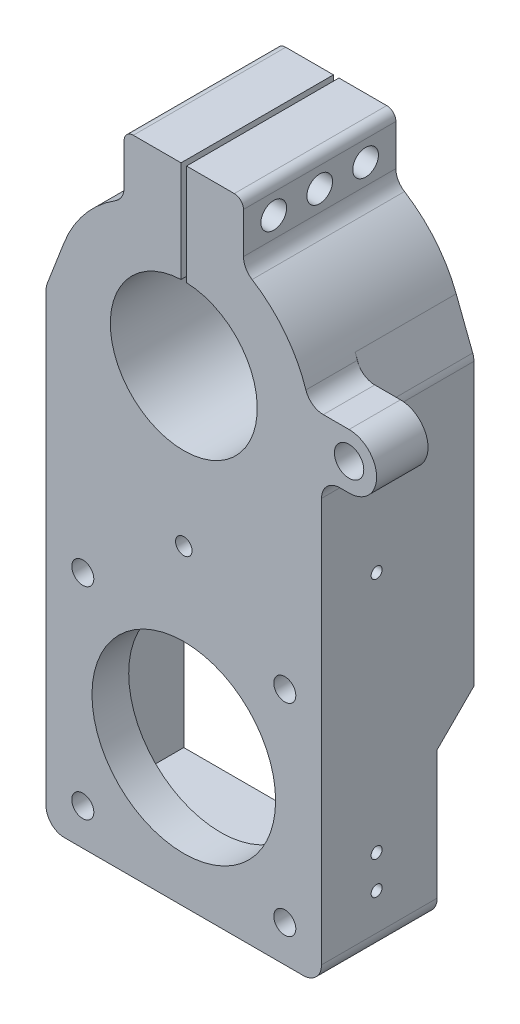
ISO-10303-21;
HEADER;
FILE_DESCRIPTION(('STEP AP214'),'2;1');
FILE_NAME('part.step','',(''),(''),'','','');
FILE_SCHEMA(('AUTOMOTIVE_DESIGN { 1 0 10303 214 1 1 1 1 }'));
ENDSEC;
DATA;
#1=APPLICATION_CONTEXT('core data for automotive mechanical design processes');
#2=APPLICATION_PROTOCOL_DEFINITION('international standard','automotive_design',2000,#1);
#3=PRODUCT_CONTEXT('',#1,'mechanical');
#4=PRODUCT('Part','Part','',(#3));
#5=PRODUCT_RELATED_PRODUCT_CATEGORY('part','',(#4));
#6=PRODUCT_DEFINITION_FORMATION('','',#4);
#7=PRODUCT_DEFINITION_CONTEXT('part definition',#1,'design');
#8=PRODUCT_DEFINITION('design','',#6,#7);
#9=PRODUCT_DEFINITION_SHAPE('','',#8);
#10=(LENGTH_UNIT() NAMED_UNIT(*) SI_UNIT(.MILLI.,.METRE.));
#11=(NAMED_UNIT(*) PLANE_ANGLE_UNIT() SI_UNIT($,.RADIAN.));
#12=(NAMED_UNIT(*) SI_UNIT($,.STERADIAN.) SOLID_ANGLE_UNIT());
#13=UNCERTAINTY_MEASURE_WITH_UNIT(LENGTH_MEASURE(1.E-05),#10,'distance_accuracy_value','');
#14=(GEOMETRIC_REPRESENTATION_CONTEXT(3) GLOBAL_UNCERTAINTY_ASSIGNED_CONTEXT((#13)) GLOBAL_UNIT_ASSIGNED_CONTEXT((#10,
#11,#12)) REPRESENTATION_CONTEXT('',''));
#15=CARTESIAN_POINT('',(0.,0.,0.));
#16=DIRECTION('',(0.,0.,1.));
#17=DIRECTION('',(1.,0.,0.));
#18=AXIS2_PLACEMENT_3D('',#15,#16,#17);
#19=CARTESIAN_POINT('',(0.,275.,28.));
#20=DIRECTION('',(0.,-1.,0.));
#21=DIRECTION('',(0.,0.,-1.));
#22=AXIS2_PLACEMENT_3D('',#19,#20,#21);
#23=PLANE('',#22);
#24=DIRECTION('',(-1.,0.,0.));
#25=VECTOR('',#24,1.);
#26=CARTESIAN_POINT('',(0.,275.,28.));
#27=LINE('',#26,#25);
#28=CARTESIAN_POINT('',(-1.5,275.,28.));
#29=VERTEX_POINT('',#28);
#30=CARTESIAN_POINT('',(-27.4999999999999,275.,28.));
#31=VERTEX_POINT('',#30);
#32=EDGE_CURVE('E639',#29,#31,#27,.T.);
#33=ORIENTED_EDGE('',*,*,#32,.F.);
#34=DIRECTION('',(0.,0.,1.));
#35=VECTOR('',#34,1.);
#36=CARTESIAN_POINT('',(-1.50000000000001,275.,-58.7600508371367));
#37=LINE('',#36,#35);
#38=CARTESIAN_POINT('',(-1.50000000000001,275.,-55.));
#39=VERTEX_POINT('',#38);
#40=EDGE_CURVE('E448',#39,#29,#37,.T.);
#41=ORIENTED_EDGE('',*,*,#40,.F.);
#42=DIRECTION('',(1.,0.,0.));
#43=VECTOR('',#42,1.);
#44=CARTESIAN_POINT('',(27.5,275.,-55.));
#45=LINE('',#44,#43);
#46=CARTESIAN_POINT('',(-27.4999999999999,275.,-55.));
#47=VERTEX_POINT('',#46);
#48=EDGE_CURVE('E557',#47,#39,#45,.T.);
#49=ORIENTED_EDGE('',*,*,#48,.F.);
#50=DIRECTION('',(0.,0.,-1.));
#51=VECTOR('',#50,1.);
#52=CARTESIAN_POINT('',(-27.4999999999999,275.,28.));
#53=LINE('',#52,#51);
#54=EDGE_CURVE('E315',#31,#47,#53,.T.);
#55=ORIENTED_EDGE('',*,*,#54,.F.);
#56=EDGE_LOOP('',(#33,#41,#49,#55));
#57=FACE_BOUND('',#56,.T.);
#58=ADVANCED_FACE('F36',(#57),#23,.F.);
#59=CARTESIAN_POINT('',(0.,95.,28.));
#60=DIRECTION('',(0.,0.,-1.));
#61=DIRECTION('',(-1.,0.,0.));
#62=AXIS2_PLACEMENT_3D('',#59,#60,#61);
#63=CYLINDRICAL_SURFACE('',#62,4.5);
#64=CARTESIAN_POINT('',(0.,95.,28.));
#65=DIRECTION('',(0.,0.,1.));
#66=DIRECTION('',(1.,0.,0.));
#67=AXIS2_PLACEMENT_3D('',#64,#65,#66);
#68=CIRCLE('',#67,4.5);
#69=CARTESIAN_POINT('',(4.5,95.,28.));
#70=VERTEX_POINT('',#69);
#71=EDGE_CURVE('E609',#70,#70,#68,.T.);
#72=ORIENTED_EDGE('',*,*,#71,.T.);
#73=EDGE_LOOP('',(#72));
#74=FACE_BOUND('',#73,.T.);
#75=CARTESIAN_POINT('',(0.,95.,8.));
#76=DIRECTION('',(0.,0.,-1.));
#77=DIRECTION('',(-1.,0.,0.));
#78=AXIS2_PLACEMENT_3D('',#75,#76,#77);
#79=CIRCLE('',#78,4.5);
#80=CARTESIAN_POINT('',(-4.5,95.,8.));
#81=VERTEX_POINT('',#80);
#82=EDGE_CURVE('E518',#81,#81,#79,.T.);
#83=ORIENTED_EDGE('',*,*,#82,.T.);
#84=EDGE_LOOP('',(#83));
#85=FACE_BOUND('',#84,.T.);
#86=ADVANCED_FACE('F837',(#74,#85),#63,.F.);
#87=CARTESIAN_POINT('',(0.,0.,28.));
#88=DIRECTION('',(0.,0.,-1.));
#89=DIRECTION('',(-1.,0.,0.));
#90=AXIS2_PLACEMENT_3D('',#87,#88,#89);
#91=CYLINDRICAL_SURFACE('',#90,50.);
#92=CARTESIAN_POINT('',(0.,0.,28.));
#93=DIRECTION('',(0.,0.,1.));
#94=DIRECTION('',(1.,0.,0.));
#95=AXIS2_PLACEMENT_3D('',#92,#93,#94);
#96=CIRCLE('',#95,50.);
#97=CARTESIAN_POINT('',(50.,0.,28.));
#98=VERTEX_POINT('',#97);
#99=EDGE_CURVE('E606',#98,#98,#96,.T.);
#100=ORIENTED_EDGE('',*,*,#99,.T.);
#101=EDGE_LOOP('',(#100));
#102=FACE_BOUND('',#101,.T.);
#103=CARTESIAN_POINT('',(0.,0.,8.));
#104=DIRECTION('',(0.,0.,-1.));
#105=DIRECTION('',(-1.,0.,0.));
#106=AXIS2_PLACEMENT_3D('',#103,#104,#105);
#107=CIRCLE('',#106,50.);
#108=CARTESIAN_POINT('',(-50.,0.,8.));
#109=VERTEX_POINT('',#108);
#110=EDGE_CURVE('E515',#109,#109,#107,.T.);
#111=ORIENTED_EDGE('',*,*,#110,.T.);
#112=EDGE_LOOP('',(#111));
#113=FACE_BOUND('',#112,.T.);
#114=ADVANCED_FACE('F842',(#102,#113),#91,.F.);
#115=CARTESIAN_POINT('',(55.,-55.,28.));
#116=DIRECTION('',(0.,0.,-1.));
#117=DIRECTION('',(-1.,0.,0.));
#118=AXIS2_PLACEMENT_3D('',#115,#116,#117);
#119=CYLINDRICAL_SURFACE('',#118,6.);
#120=CARTESIAN_POINT('',(55.,-55.,28.));
#121=DIRECTION('',(0.,0.,1.));
#122=DIRECTION('',(1.,0.,0.));
#123=AXIS2_PLACEMENT_3D('',#120,#121,#122);
#124=CIRCLE('',#123,6.);
#125=CARTESIAN_POINT('',(61.,-55.,28.));
#126=VERTEX_POINT('',#125);
#127=EDGE_CURVE('E594',#126,#126,#124,.T.);
#128=ORIENTED_EDGE('',*,*,#127,.T.);
#129=EDGE_LOOP('',(#128));
#130=FACE_BOUND('',#129,.T.);
#131=CARTESIAN_POINT('',(55.,-55.,8.));
#132=DIRECTION('',(0.,0.,-1.));
#133=DIRECTION('',(-1.,0.,0.));
#134=AXIS2_PLACEMENT_3D('',#131,#132,#133);
#135=CIRCLE('',#134,6.);
#136=CARTESIAN_POINT('',(49.,-55.,8.));
#137=VERTEX_POINT('',#136);
#138=EDGE_CURVE('E512',#137,#137,#135,.T.);
#139=ORIENTED_EDGE('',*,*,#138,.T.);
#140=EDGE_LOOP('',(#139));
#141=FACE_BOUND('',#140,.T.);
#142=ADVANCED_FACE('F1017',(#130,#141),#119,.F.);
#143=CARTESIAN_POINT('',(-55.,-55.,28.));
#144=DIRECTION('',(0.,0.,-1.));
#145=DIRECTION('',(-1.,0.,0.));
#146=AXIS2_PLACEMENT_3D('',#143,#144,#145);
#147=CYLINDRICAL_SURFACE('',#146,6.);
#148=CARTESIAN_POINT('',(-55.,-55.,28.));
#149=DIRECTION('',(0.,0.,1.));
#150=DIRECTION('',(-1.,0.,0.));
#151=AXIS2_PLACEMENT_3D('',#148,#149,#150);
#152=CIRCLE('',#151,6.);
#153=CARTESIAN_POINT('',(-61.,-55.,28.));
#154=VERTEX_POINT('',#153);
#155=EDGE_CURVE('E591',#154,#154,#152,.T.);
#156=ORIENTED_EDGE('',*,*,#155,.T.);
#157=EDGE_LOOP('',(#156));
#158=FACE_BOUND('',#157,.T.);
#159=CARTESIAN_POINT('',(-55.,-55.,8.));
#160=DIRECTION('',(0.,0.,-1.));
#161=DIRECTION('',(-1.,0.,0.));
#162=AXIS2_PLACEMENT_3D('',#159,#160,#161);
#163=CIRCLE('',#162,6.);
#164=CARTESIAN_POINT('',(-61.,-55.,8.));
#165=VERTEX_POINT('',#164);
#166=EDGE_CURVE('E509',#165,#165,#163,.T.);
#167=ORIENTED_EDGE('',*,*,#166,.T.);
#168=EDGE_LOOP('',(#167));
#169=FACE_BOUND('',#168,.T.);
#170=ADVANCED_FACE('F1013',(#158,#169),#147,.F.);
#171=CARTESIAN_POINT('',(55.,55.,28.));
#172=DIRECTION('',(0.,0.,-1.));
#173=DIRECTION('',(-1.,0.,0.));
#174=AXIS2_PLACEMENT_3D('',#171,#172,#173);
#175=CYLINDRICAL_SURFACE('',#174,6.);
#176=CARTESIAN_POINT('',(55.,55.,28.));
#177=DIRECTION('',(0.,0.,1.));
#178=DIRECTION('',(-1.,0.,0.));
#179=AXIS2_PLACEMENT_3D('',#176,#177,#178);
#180=CIRCLE('',#179,6.);
#181=CARTESIAN_POINT('',(49.,55.,28.));
#182=VERTEX_POINT('',#181);
#183=EDGE_CURVE('E588',#182,#182,#180,.T.);
#184=ORIENTED_EDGE('',*,*,#183,.T.);
#185=EDGE_LOOP('',(#184));
#186=FACE_BOUND('',#185,.T.);
#187=CARTESIAN_POINT('',(55.,55.,8.));
#188=DIRECTION('',(0.,0.,-1.));
#189=DIRECTION('',(-1.,0.,0.));
#190=AXIS2_PLACEMENT_3D('',#187,#188,#189);
#191=CIRCLE('',#190,6.);
#192=CARTESIAN_POINT('',(49.,55.,8.));
#193=VERTEX_POINT('',#192);
#194=EDGE_CURVE('E353',#193,#193,#191,.T.);
#195=ORIENTED_EDGE('',*,*,#194,.T.);
#196=EDGE_LOOP('',(#195));
#197=FACE_BOUND('',#196,.T.);
#198=ADVANCED_FACE('F1009',(#186,#197),#175,.F.);
#199=CARTESIAN_POINT('',(-55.,55.,28.));
#200=DIRECTION('',(0.,0.,-1.));
#201=DIRECTION('',(-1.,0.,0.));
#202=AXIS2_PLACEMENT_3D('',#199,#200,#201);
#203=CYLINDRICAL_SURFACE('',#202,6.);
#204=CARTESIAN_POINT('',(-55.,55.,28.));
#205=DIRECTION('',(0.,0.,1.));
#206=DIRECTION('',(1.,0.,0.));
#207=AXIS2_PLACEMENT_3D('',#204,#205,#206);
#208=CIRCLE('',#207,6.);
#209=CARTESIAN_POINT('',(-49.,55.,28.));
#210=VERTEX_POINT('',#209);
#211=EDGE_CURVE('E585',#210,#210,#208,.T.);
#212=ORIENTED_EDGE('',*,*,#211,.T.);
#213=EDGE_LOOP('',(#212));
#214=FACE_BOUND('',#213,.T.);
#215=CARTESIAN_POINT('',(-55.,55.,8.));
#216=DIRECTION('',(0.,0.,-1.));
#217=DIRECTION('',(-1.,0.,0.));
#218=AXIS2_PLACEMENT_3D('',#215,#216,#217);
#219=CIRCLE('',#218,6.);
#220=CARTESIAN_POINT('',(-61.,55.,8.));
#221=VERTEX_POINT('',#220);
#222=EDGE_CURVE('E350',#221,#221,#219,.T.);
#223=ORIENTED_EDGE('',*,*,#222,.T.);
#224=EDGE_LOOP('',(#223));
#225=FACE_BOUND('',#224,.T.);
#226=ADVANCED_FACE('F1006',(#214,#225),#203,.F.);
#227=CARTESIAN_POINT('',(65.,-65.,28.));
#228=DIRECTION('',(0.,0.,-1.));
#229=DIRECTION('',(-1.,0.,0.));
#230=AXIS2_PLACEMENT_3D('',#227,#228,#229);
#231=PLANE('',#230);
#232=CARTESIAN_POINT('',(0.,180.,28.));
#233=DIRECTION('',(0.,0.,1.));
#234=DIRECTION('',(1.,0.,0.));
#235=AXIS2_PLACEMENT_3D('',#232,#233,#234);
#236=CIRCLE('',#235,40.);
#237=CARTESIAN_POINT('',(-1.5,219.971865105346,28.));
#238=VERTEX_POINT('',#237);
#239=CARTESIAN_POINT('',(1.5,219.971865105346,28.));
#240=VERTEX_POINT('',#239);
#241=EDGE_CURVE('E601',#238,#240,#236,.T.);
#242=ORIENTED_EDGE('',*,*,#241,.F.);
#243=DIRECTION('',(0.,1.,0.));
#244=VECTOR('',#243,1.);
#245=CARTESIAN_POINT('',(-1.49999999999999,-65.,28.));
#246=LINE('',#245,#244);
#247=EDGE_CURVE('E461',#238,#29,#246,.T.);
#248=ORIENTED_EDGE('',*,*,#247,.T.);
#249=ORIENTED_EDGE('',*,*,#32,.T.);
#250=CARTESIAN_POINT('',(-27.5,270.,28.));
#251=DIRECTION('',(0.,0.,1.));
#252=DIRECTION('',(-1.,0.,0.));
#253=AXIS2_PLACEMENT_3D('',#250,#251,#252);
#254=CIRCLE('',#253,5.);
#255=CARTESIAN_POINT('',(-32.5,270.,28.));
#256=VERTEX_POINT('',#255);
#257=EDGE_CURVE('E643',#31,#256,#254,.T.);
#258=ORIENTED_EDGE('',*,*,#257,.T.);
#259=DIRECTION('',(0.,-1.,0.));
#260=VECTOR('',#259,1.);
#261=CARTESIAN_POINT('',(-32.5,270.,28.));
#262=LINE('',#261,#260);
#263=CARTESIAN_POINT('',(-32.4999999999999,247.777187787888,28.));
#264=VERTEX_POINT('',#263);
#265=EDGE_CURVE('E645',#256,#264,#262,.T.);
#266=ORIENTED_EDGE('',*,*,#265,.T.);
#267=CARTESIAN_POINT('',(-42.4999999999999,247.777187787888,28.));
#268=DIRECTION('',(0.,0.,-1.));
#269=DIRECTION('',(-1.,0.,0.));
#270=AXIS2_PLACEMENT_3D('',#267,#268,#269);
#271=CIRCLE('',#270,10.);
#272=CARTESIAN_POINT('',(-37.1874988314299,239.305037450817,28.));
#273=VERTEX_POINT('',#272);
#274=EDGE_CURVE('E647',#264,#273,#271,.T.);
#275=ORIENTED_EDGE('',*,*,#274,.T.);
#276=CARTESIAN_POINT('',(0.,180.,28.));
#277=DIRECTION('',(0.,0.,1.));
#278=DIRECTION('',(1.,0.,0.));
#279=AXIS2_PLACEMENT_3D('',#276,#277,#278);
#280=CIRCLE('',#279,69.9999824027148);
#281=CARTESIAN_POINT('',(-65.3333004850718,205.130805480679,28.));
#282=VERTEX_POINT('',#281);
#283=EDGE_CURVE('E649',#273,#282,#280,.T.);
#284=ORIENTED_EDGE('',*,*,#283,.T.);
#285=DIRECTION('',(-0.359011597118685,-0.933333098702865,0.));
#286=VECTOR('',#285,1.);
#287=CARTESIAN_POINT('',(-74.3333309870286,181.733159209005,28.));
#288=LINE('',#287,#286);
#289=CARTESIAN_POINT('',(-74.3333309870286,181.733159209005,28.));
#290=VERTEX_POINT('',#289);
#291=EDGE_CURVE('E303',#282,#290,#288,.T.);
#292=ORIENTED_EDGE('',*,*,#291,.T.);
#293=CARTESIAN_POINT('',(-65.,178.143043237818,28.));
#294=DIRECTION('',(0.,0.,1.));
#295=DIRECTION('',(1.,0.,0.));
#296=AXIS2_PLACEMENT_3D('',#293,#294,#295);
#297=CIRCLE('',#296,10.);
#298=CARTESIAN_POINT('',(-75.,178.143043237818,28.));
#299=VERTEX_POINT('',#298);
#300=EDGE_CURVE('E652',#290,#299,#297,.T.);
#301=ORIENTED_EDGE('',*,*,#300,.T.);
#302=DIRECTION('',(0.,-1.,0.));
#303=VECTOR('',#302,1.);
#304=CARTESIAN_POINT('',(-75.,-64.9999999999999,28.));
#305=LINE('',#304,#303);
#306=CARTESIAN_POINT('',(-75.,-64.9999999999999,28.));
#307=VERTEX_POINT('',#306);
#308=EDGE_CURVE('E654',#299,#307,#305,.T.);
#309=ORIENTED_EDGE('',*,*,#308,.T.);
#310=CARTESIAN_POINT('',(-65.,-65.,28.));
#311=DIRECTION('',(0.,0.,1.));
#312=DIRECTION('',(1.,0.,0.));
#313=AXIS2_PLACEMENT_3D('',#310,#311,#312);
#314=CIRCLE('',#313,9.99999999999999);
#315=CARTESIAN_POINT('',(-64.9999999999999,-75.,28.));
#316=VERTEX_POINT('',#315);
#317=EDGE_CURVE('E656',#307,#316,#314,.T.);
#318=ORIENTED_EDGE('',*,*,#317,.T.);
#319=DIRECTION('',(1.,0.,0.));
#320=VECTOR('',#319,1.);
#321=CARTESIAN_POINT('',(0.,-75.,28.));
#322=LINE('',#321,#320);
#323=CARTESIAN_POINT('',(64.9999999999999,-75.,28.));
#324=VERTEX_POINT('',#323);
#325=EDGE_CURVE('E613',#316,#324,#322,.T.);
#326=ORIENTED_EDGE('',*,*,#325,.T.);
#327=CARTESIAN_POINT('',(65.,-65.,28.));
#328=DIRECTION('',(0.,0.,1.));
#329=DIRECTION('',(-1.,0.,0.));
#330=AXIS2_PLACEMENT_3D('',#327,#328,#329);
#331=CIRCLE('',#330,9.99999999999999);
#332=CARTESIAN_POINT('',(75.,-64.9999999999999,28.));
#333=VERTEX_POINT('',#332);
#334=EDGE_CURVE('E616',#324,#333,#331,.T.);
#335=ORIENTED_EDGE('',*,*,#334,.T.);
#336=DIRECTION('',(0.,1.,0.));
#337=VECTOR('',#336,1.);
#338=CARTESIAN_POINT('',(75.,-64.9999999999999,28.));
#339=LINE('',#338,#337);
#340=CARTESIAN_POINT('',(75.,155.,28.));
#341=VERTEX_POINT('',#340);
#342=EDGE_CURVE('E619',#333,#341,#339,.T.);
#343=ORIENTED_EDGE('',*,*,#342,.T.);
#344=CARTESIAN_POINT('',(85.,155.,28.));
#345=DIRECTION('',(0.,0.,-1.));
#346=DIRECTION('',(-1.,0.,0.));
#347=AXIS2_PLACEMENT_3D('',#344,#345,#346);
#348=CIRCLE('',#347,10.);
#349=CARTESIAN_POINT('',(85.,165.,28.));
#350=VERTEX_POINT('',#349);
#351=EDGE_CURVE('E621',#341,#350,#348,.T.);
#352=ORIENTED_EDGE('',*,*,#351,.T.);
#353=DIRECTION('',(1.,0.,0.));
#354=VECTOR('',#353,1.);
#355=CARTESIAN_POINT('',(90.,165.,28.));
#356=LINE('',#355,#354);
#357=CARTESIAN_POINT('',(90.,165.,28.));
#358=VERTEX_POINT('',#357);
#359=EDGE_CURVE('E623',#350,#358,#356,.T.);
#360=ORIENTED_EDGE('',*,*,#359,.T.);
#361=CARTESIAN_POINT('',(90.,180.,28.));
#362=DIRECTION('',(0.,0.,1.));
#363=DIRECTION('',(1.,0.,0.));
#364=AXIS2_PLACEMENT_3D('',#361,#362,#363);
#365=CIRCLE('',#364,15.);
#366=CARTESIAN_POINT('',(90.,195.,28.));
#367=VERTEX_POINT('',#366);
#368=EDGE_CURVE('E625',#358,#367,#365,.T.);
#369=ORIENTED_EDGE('',*,*,#368,.T.);
#370=DIRECTION('',(-1.,0.,0.));
#371=VECTOR('',#370,1.);
#372=CARTESIAN_POINT('',(90.,195.,28.));
#373=LINE('',#372,#371);
#374=CARTESIAN_POINT('',(75.9934022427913,195.,28.));
#375=VERTEX_POINT('',#374);
#376=EDGE_CURVE('E627',#367,#375,#373,.T.);
#377=ORIENTED_EDGE('',*,*,#376,.T.);
#378=CARTESIAN_POINT('',(75.9934022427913,205.,28.));
#379=DIRECTION('',(0.,0.,-1.));
#380=DIRECTION('',(1.,0.,0.));
#381=AXIS2_PLACEMENT_3D('',#378,#379,#380);
#382=CIRCLE('',#381,10.);
#383=CARTESIAN_POINT('',(66.4942248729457,201.874999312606,28.));
#384=VERTEX_POINT('',#383);
#385=EDGE_CURVE('E629',#375,#384,#382,.T.);
#386=ORIENTED_EDGE('',*,*,#385,.T.);
#387=CARTESIAN_POINT('',(0.,180.,28.));
#388=DIRECTION('',(0.,0.,1.));
#389=DIRECTION('',(1.,0.,0.));
#390=AXIS2_PLACEMENT_3D('',#387,#388,#389);
#391=CIRCLE('',#390,69.9999824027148);
#392=CARTESIAN_POINT('',(37.1874988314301,239.305037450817,28.));
#393=VERTEX_POINT('',#392);
#394=EDGE_CURVE('E631',#384,#393,#391,.T.);
#395=ORIENTED_EDGE('',*,*,#394,.T.);
#396=CARTESIAN_POINT('',(42.5000000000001,247.777187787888,28.));
#397=DIRECTION('',(0.,0.,-1.));
#398=DIRECTION('',(1.,0.,0.));
#399=AXIS2_PLACEMENT_3D('',#396,#397,#398);
#400=CIRCLE('',#399,10.);
#401=CARTESIAN_POINT('',(32.5000000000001,247.777187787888,28.));
#402=VERTEX_POINT('',#401);
#403=EDGE_CURVE('E633',#393,#402,#400,.T.);
#404=ORIENTED_EDGE('',*,*,#403,.T.);
#405=DIRECTION('',(0.,1.,0.));
#406=VECTOR('',#405,1.);
#407=CARTESIAN_POINT('',(32.5,270.,28.));
#408=LINE('',#407,#406);
#409=CARTESIAN_POINT('',(32.5,270.,28.));
#410=VERTEX_POINT('',#409);
#411=EDGE_CURVE('E635',#402,#410,#408,.T.);
#412=ORIENTED_EDGE('',*,*,#411,.T.);
#413=CARTESIAN_POINT('',(27.5,270.,28.));
#414=DIRECTION('',(0.,0.,1.));
#415=DIRECTION('',(-1.,0.,0.));
#416=AXIS2_PLACEMENT_3D('',#413,#414,#415);
#417=CIRCLE('',#416,5.);
#418=CARTESIAN_POINT('',(27.5,275.,28.));
#419=VERTEX_POINT('',#418);
#420=EDGE_CURVE('E637',#410,#419,#417,.T.);
#421=ORIENTED_EDGE('',*,*,#420,.T.);
#422=CARTESIAN_POINT('',(1.5,275.,28.));
#423=VERTEX_POINT('',#422);
#424=EDGE_CURVE('E640',#419,#423,#27,.T.);
#425=ORIENTED_EDGE('',*,*,#424,.T.);
#426=DIRECTION('',(0.,-1.,0.));
#427=VECTOR('',#426,1.);
#428=CARTESIAN_POINT('',(1.5,-65.,28.));
#429=LINE('',#428,#427);
#430=EDGE_CURVE('E456',#423,#240,#429,.T.);
#431=ORIENTED_EDGE('',*,*,#430,.T.);
#432=EDGE_LOOP('',(#242,#248,#249,#258,#266,#275,#284,#292,#301,#309,#318,#326,#335,#343,#352,
#360,#369,#377,#386,#395,#404,#412,#421,#425,#431));
#433=FACE_BOUND('',#432,.T.);
#434=ORIENTED_EDGE('',*,*,#71,.F.);
#435=EDGE_LOOP('',(#434));
#436=FACE_BOUND('',#435,.T.);
#437=ORIENTED_EDGE('',*,*,#99,.F.);
#438=EDGE_LOOP('',(#437));
#439=FACE_BOUND('',#438,.T.);
#440=CARTESIAN_POINT('',(90.,180.,28.));
#441=DIRECTION('',(0.,0.,1.));
#442=DIRECTION('',(1.,0.,0.));
#443=AXIS2_PLACEMENT_3D('',#440,#441,#442);
#444=CIRCLE('',#443,8.00000000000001);
#445=CARTESIAN_POINT('',(98.,180.,28.));
#446=VERTEX_POINT('',#445);
#447=EDGE_CURVE('E598',#446,#446,#444,.T.);
#448=ORIENTED_EDGE('',*,*,#447,.F.);
#449=EDGE_LOOP('',(#448));
#450=FACE_BOUND('',#449,.T.);
#451=ORIENTED_EDGE('',*,*,#127,.F.);
#452=EDGE_LOOP('',(#451));
#453=FACE_BOUND('',#452,.T.);
#454=ORIENTED_EDGE('',*,*,#155,.F.);
#455=EDGE_LOOP('',(#454));
#456=FACE_BOUND('',#455,.T.);
#457=ORIENTED_EDGE('',*,*,#183,.F.);
#458=EDGE_LOOP('',(#457));
#459=FACE_BOUND('',#458,.T.);
#460=ORIENTED_EDGE('',*,*,#211,.F.);
#461=EDGE_LOOP('',(#460));
#462=FACE_BOUND('',#461,.T.);
#463=ADVANCED_FACE('F746',(#433,#436,#439,#450,#453,#456,#459,#462),#231,.F.);
#464=CARTESIAN_POINT('',(65.,-65.,0.));
#465=DIRECTION('',(0.,0.,-1.));
#466=DIRECTION('',(-1.,0.,0.));
#467=AXIS2_PLACEMENT_3D('',#464,#465,#466);
#468=PLANE('',#467);
#469=DIRECTION('',(0.,-1.,0.));
#470=VECTOR('',#469,1.);
#471=CARTESIAN_POINT('',(75.,178.143043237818,0.));
#472=LINE('',#471,#470);
#473=CARTESIAN_POINT('',(75.,178.143043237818,0.));
#474=VERTEX_POINT('',#473);
#475=CARTESIAN_POINT('',(75.,155.,0.));
#476=VERTEX_POINT('',#475);
#477=EDGE_CURVE('E529',#474,#476,#472,.T.);
#478=ORIENTED_EDGE('',*,*,#477,.F.);
#479=CARTESIAN_POINT('',(65.,178.143043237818,0.));
#480=DIRECTION('',(0.,0.,-1.));
#481=DIRECTION('',(1.,0.,0.));
#482=AXIS2_PLACEMENT_3D('',#479,#480,#481);
#483=CIRCLE('',#482,10.);
#484=CARTESIAN_POINT('',(74.3333309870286,181.733159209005,0.));
#485=VERTEX_POINT('',#484);
#486=EDGE_CURVE('E572',#485,#474,#483,.T.);
#487=ORIENTED_EDGE('',*,*,#486,.F.);
#488=DIRECTION('',(0.359011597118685,-0.933333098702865,0.));
#489=VECTOR('',#488,1.);
#490=CARTESIAN_POINT('',(65.3333004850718,205.130805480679,0.));
#491=LINE('',#490,#489);
#492=CARTESIAN_POINT('',(67.2513017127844,200.144520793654,0.));
#493=VERTEX_POINT('',#492);
#494=EDGE_CURVE('E349',#493,#485,#491,.T.);
#495=ORIENTED_EDGE('',*,*,#494,.F.);
#496=CARTESIAN_POINT('',(75.9934022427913,205.,0.));
#497=DIRECTION('',(0.,0.,-1.));
#498=DIRECTION('',(1.,0.,0.));
#499=AXIS2_PLACEMENT_3D('',#496,#497,#498);
#500=CIRCLE('',#499,10.);
#501=CARTESIAN_POINT('',(75.9934022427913,195.,0.));
#502=VERTEX_POINT('',#501);
#503=EDGE_CURVE('E668',#502,#493,#500,.T.);
#504=ORIENTED_EDGE('',*,*,#503,.F.);
#505=DIRECTION('',(-1.,0.,0.));
#506=VECTOR('',#505,1.);
#507=CARTESIAN_POINT('',(90.,195.,0.));
#508=LINE('',#507,#506);
#509=CARTESIAN_POINT('',(90.,195.,0.));
#510=VERTEX_POINT('',#509);
#511=EDGE_CURVE('E665',#510,#502,#508,.T.);
#512=ORIENTED_EDGE('',*,*,#511,.F.);
#513=CARTESIAN_POINT('',(90.,180.,0.));
#514=DIRECTION('',(0.,0.,1.));
#515=DIRECTION('',(1.,0.,0.));
#516=AXIS2_PLACEMENT_3D('',#513,#514,#515);
#517=CIRCLE('',#516,15.);
#518=CARTESIAN_POINT('',(90.,165.,0.));
#519=VERTEX_POINT('',#518);
#520=EDGE_CURVE('E663',#519,#510,#517,.T.);
#521=ORIENTED_EDGE('',*,*,#520,.F.);
#522=DIRECTION('',(1.,0.,0.));
#523=VECTOR('',#522,1.);
#524=CARTESIAN_POINT('',(90.,165.,0.));
#525=LINE('',#524,#523);
#526=CARTESIAN_POINT('',(85.,165.,0.));
#527=VERTEX_POINT('',#526);
#528=EDGE_CURVE('E661',#527,#519,#525,.T.);
#529=ORIENTED_EDGE('',*,*,#528,.F.);
#530=CARTESIAN_POINT('',(85.,155.,0.));
#531=DIRECTION('',(0.,0.,-1.));
#532=DIRECTION('',(-1.,0.,0.));
#533=AXIS2_PLACEMENT_3D('',#530,#531,#532);
#534=CIRCLE('',#533,10.);
#535=EDGE_CURVE('E612',#476,#527,#534,.T.);
#536=ORIENTED_EDGE('',*,*,#535,.F.);
#537=EDGE_LOOP('',(#478,#487,#495,#504,#512,#521,#529,#536));
#538=FACE_BOUND('',#537,.T.);
#539=CARTESIAN_POINT('',(90.,180.,0.));
#540=DIRECTION('',(0.,0.,1.));
#541=DIRECTION('',(1.,0.,0.));
#542=AXIS2_PLACEMENT_3D('',#539,#540,#541);
#543=CIRCLE('',#542,8.00000000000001);
#544=CARTESIAN_POINT('',(98.,180.,0.));
#545=VERTEX_POINT('',#544);
#546=EDGE_CURVE('E597',#545,#545,#543,.T.);
#547=ORIENTED_EDGE('',*,*,#546,.T.);
#548=EDGE_LOOP('',(#547));
#549=FACE_BOUND('',#548,.T.);
#550=ADVANCED_FACE('F731',(#538,#549),#468,.T.);
#551=CARTESIAN_POINT('',(65.,-65.,28.));
#552=DIRECTION('',(0.,0.,-1.));
#553=DIRECTION('',(-1.,0.,0.));
#554=AXIS2_PLACEMENT_3D('',#551,#552,#553);
#555=CYLINDRICAL_SURFACE('',#554,9.99999999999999);
#556=DIRECTION('',(0.,0.,-1.));
#557=VECTOR('',#556,1.);
#558=CARTESIAN_POINT('',(64.9999999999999,-75.,28.));
#559=LINE('',#558,#557);
#560=CARTESIAN_POINT('',(64.9999999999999,-75.,-35.));
#561=VERTEX_POINT('',#560);
#562=EDGE_CURVE('E346',#324,#561,#559,.T.);
#563=ORIENTED_EDGE('',*,*,#562,.T.);
#564=CARTESIAN_POINT('',(65.,-65.,-35.));
#565=DIRECTION('',(0.,0.,1.));
#566=DIRECTION('',(0.,-1.,0.));
#567=AXIS2_PLACEMENT_3D('',#564,#565,#566);
#568=CIRCLE('',#567,9.99999999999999);
#569=CARTESIAN_POINT('',(75.,-64.9999999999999,-35.));
#570=VERTEX_POINT('',#569);
#571=EDGE_CURVE('E408',#561,#570,#568,.T.);
#572=ORIENTED_EDGE('',*,*,#571,.T.);
#573=DIRECTION('',(0.,0.,-1.));
#574=VECTOR('',#573,1.);
#575=CARTESIAN_POINT('',(75.,-64.9999999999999,28.));
#576=LINE('',#575,#574);
#577=EDGE_CURVE('E343',#333,#570,#576,.T.);
#578=ORIENTED_EDGE('',*,*,#577,.F.);
#579=ORIENTED_EDGE('',*,*,#334,.F.);
#580=EDGE_LOOP('',(#563,#572,#578,#579));
#581=FACE_BOUND('',#580,.T.);
#582=ADVANCED_FACE('F38',(#581),#555,.T.);
#583=CARTESIAN_POINT('',(75.,-64.9999999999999,28.));
#584=DIRECTION('',(-1.,0.,0.));
#585=DIRECTION('',(0.,-1.,0.));
#586=AXIS2_PLACEMENT_3D('',#583,#584,#585);
#587=PLANE('',#586);
#588=CARTESIAN_POINT('',(75.,-27.,-2.));
#589=DIRECTION('',(1.,0.,0.));
#590=DIRECTION('',(0.,1.,0.));
#591=AXIS2_PLACEMENT_3D('',#588,#589,#590);
#592=CIRCLE('',#591,3.);
#593=CARTESIAN_POINT('',(75.,-24.,-2.));
#594=VERTEX_POINT('',#593);
#595=EDGE_CURVE('E884',#594,#594,#592,.T.);
#596=ORIENTED_EDGE('',*,*,#595,.F.);
#597=EDGE_LOOP('',(#596));
#598=FACE_BOUND('',#597,.T.);
#599=CARTESIAN_POINT('',(75.,105.,-2.));
#600=DIRECTION('',(1.,0.,0.));
#601=DIRECTION('',(0.,1.,0.));
#602=AXIS2_PLACEMENT_3D('',#599,#600,#601);
#603=CIRCLE('',#602,3.);
#604=CARTESIAN_POINT('',(75.,108.,-2.));
#605=VERTEX_POINT('',#604);
#606=EDGE_CURVE('E298',#605,#605,#603,.T.);
#607=ORIENTED_EDGE('',*,*,#606,.F.);
#608=EDGE_LOOP('',(#607));
#609=FACE_BOUND('',#608,.T.);
#610=CARTESIAN_POINT('',(75.,-45.,-2.));
#611=DIRECTION('',(1.,0.,0.));
#612=DIRECTION('',(0.,1.,0.));
#613=AXIS2_PLACEMENT_3D('',#610,#611,#612);
#614=CIRCLE('',#613,3.);
#615=CARTESIAN_POINT('',(75.,-42.,-2.));
#616=VERTEX_POINT('',#615);
#617=EDGE_CURVE('E702',#616,#616,#614,.T.);
#618=ORIENTED_EDGE('',*,*,#617,.F.);
#619=EDGE_LOOP('',(#618));
#620=FACE_BOUND('',#619,.T.);
#621=ORIENTED_EDGE('',*,*,#577,.T.);
#622=DIRECTION('',(0.,-1.,0.));
#623=VECTOR('',#622,1.);
#624=CARTESIAN_POINT('',(75.,4.99999999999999,-35.));
#625=LINE('',#624,#623);
#626=CARTESIAN_POINT('',(75.,4.99999999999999,-35.));
#627=VERTEX_POINT('',#626);
#628=EDGE_CURVE('E695',#627,#570,#625,.T.);
#629=ORIENTED_EDGE('',*,*,#628,.F.);
#630=DIRECTION('',(0.,-0.707106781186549,0.707106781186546));
#631=VECTOR('',#630,1.);
#632=CARTESIAN_POINT('',(75.,4.99999999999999,-35.));
#633=LINE('',#632,#631);
#634=CARTESIAN_POINT('',(75.,25.0000000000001,-55.));
#635=VERTEX_POINT('',#634);
#636=EDGE_CURVE('E699',#635,#627,#633,.T.);
#637=ORIENTED_EDGE('',*,*,#636,.F.);
#638=DIRECTION('',(0.,-1.,0.));
#639=VECTOR('',#638,1.);
#640=CARTESIAN_POINT('',(75.,178.143043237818,-55.));
#641=LINE('',#640,#639);
#642=CARTESIAN_POINT('',(75.,178.143043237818,-55.));
#643=VERTEX_POINT('',#642);
#644=EDGE_CURVE('E533',#643,#635,#641,.T.);
#645=ORIENTED_EDGE('',*,*,#644,.F.);
#646=DIRECTION('',(0.,0.,1.));
#647=VECTOR('',#646,1.);
#648=CARTESIAN_POINT('',(75.,178.143043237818,-55.));
#649=LINE('',#648,#647);
#650=EDGE_CURVE('E569',#643,#474,#649,.T.);
#651=ORIENTED_EDGE('',*,*,#650,.T.);
#652=ORIENTED_EDGE('',*,*,#477,.T.);
#653=DIRECTION('',(0.,0.,-1.));
#654=VECTOR('',#653,1.);
#655=CARTESIAN_POINT('',(75.,155.,28.));
#656=LINE('',#655,#654);
#657=EDGE_CURVE('E341',#341,#476,#656,.T.);
#658=ORIENTED_EDGE('',*,*,#657,.F.);
#659=ORIENTED_EDGE('',*,*,#342,.F.);
#660=EDGE_LOOP('',(#621,#629,#637,#645,#651,#652,#658,#659));
#661=FACE_BOUND('',#660,.T.);
#662=ADVANCED_FACE('F720',(#598,#609,#620,#661),#587,.F.);
#663=CARTESIAN_POINT('',(85.,155.,28.));
#664=DIRECTION('',(0.,0.,-1.));
#665=DIRECTION('',(-1.,0.,0.));
#666=AXIS2_PLACEMENT_3D('',#663,#664,#665);
#667=CYLINDRICAL_SURFACE('',#666,10.);
#668=ORIENTED_EDGE('',*,*,#535,.T.);
#669=DIRECTION('',(0.,0.,-1.));
#670=VECTOR('',#669,1.);
#671=CARTESIAN_POINT('',(85.,165.,28.));
#672=LINE('',#671,#670);
#673=EDGE_CURVE('E338',#350,#527,#672,.T.);
#674=ORIENTED_EDGE('',*,*,#673,.F.);
#675=ORIENTED_EDGE('',*,*,#351,.F.);
#676=ORIENTED_EDGE('',*,*,#657,.T.);
#677=EDGE_LOOP('',(#668,#674,#675,#676));
#678=FACE_BOUND('',#677,.T.);
#679=ADVANCED_FACE('F738',(#678),#667,.F.);
#680=CARTESIAN_POINT('',(90.,165.,28.));
#681=DIRECTION('',(0.,1.,0.));
#682=DIRECTION('',(0.,0.,1.));
#683=AXIS2_PLACEMENT_3D('',#680,#681,#682);
#684=PLANE('',#683);
#685=ORIENTED_EDGE('',*,*,#528,.T.);
#686=DIRECTION('',(0.,0.,-1.));
#687=VECTOR('',#686,1.);
#688=CARTESIAN_POINT('',(90.,165.,28.));
#689=LINE('',#688,#687);
#690=EDGE_CURVE('E335',#358,#519,#689,.T.);
#691=ORIENTED_EDGE('',*,*,#690,.F.);
#692=ORIENTED_EDGE('',*,*,#359,.F.);
#693=ORIENTED_EDGE('',*,*,#673,.T.);
#694=EDGE_LOOP('',(#685,#691,#692,#693));
#695=FACE_BOUND('',#694,.T.);
#696=ADVANCED_FACE('F741',(#695),#684,.F.);
#697=CARTESIAN_POINT('',(90.,180.,28.));
#698=DIRECTION('',(0.,0.,-1.));
#699=DIRECTION('',(-1.,0.,0.));
#700=AXIS2_PLACEMENT_3D('',#697,#698,#699);
#701=CYLINDRICAL_SURFACE('',#700,15.);
#702=ORIENTED_EDGE('',*,*,#520,.T.);
#703=DIRECTION('',(0.,0.,-1.));
#704=VECTOR('',#703,1.);
#705=CARTESIAN_POINT('',(90.,195.,28.));
#706=LINE('',#705,#704);
#707=EDGE_CURVE('E332',#367,#510,#706,.T.);
#708=ORIENTED_EDGE('',*,*,#707,.F.);
#709=ORIENTED_EDGE('',*,*,#368,.F.);
#710=ORIENTED_EDGE('',*,*,#690,.T.);
#711=EDGE_LOOP('',(#702,#708,#709,#710));
#712=FACE_BOUND('',#711,.T.);
#713=ADVANCED_FACE('F868',(#712),#701,.T.);
#714=CARTESIAN_POINT('',(90.,195.,28.));
#715=DIRECTION('',(0.,-1.,0.));
#716=DIRECTION('',(0.,0.,-1.));
#717=AXIS2_PLACEMENT_3D('',#714,#715,#716);
#718=PLANE('',#717);
#719=ORIENTED_EDGE('',*,*,#511,.T.);
#720=DIRECTION('',(0.,0.,-1.));
#721=VECTOR('',#720,1.);
#722=CARTESIAN_POINT('',(75.9934022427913,195.,28.));
#723=LINE('',#722,#721);
#724=EDGE_CURVE('E329',#375,#502,#723,.T.);
#725=ORIENTED_EDGE('',*,*,#724,.F.);
#726=ORIENTED_EDGE('',*,*,#376,.F.);
#727=ORIENTED_EDGE('',*,*,#707,.T.);
#728=EDGE_LOOP('',(#719,#725,#726,#727));
#729=FACE_BOUND('',#728,.T.);
#730=ADVANCED_FACE('F865',(#729),#718,.F.);
#731=CARTESIAN_POINT('',(75.9934022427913,205.,28.));
#732=DIRECTION('',(0.,0.,-1.));
#733=DIRECTION('',(-1.,0.,0.));
#734=AXIS2_PLACEMENT_3D('',#731,#732,#733);
#735=CYLINDRICAL_SURFACE('',#734,10.);
#736=ORIENTED_EDGE('',*,*,#503,.T.);
#737=CARTESIAN_POINT('',(66.4942248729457,201.874999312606,0.));
#738=VERTEX_POINT('',#737);
#739=EDGE_CURVE('E667',#493,#738,#500,.T.);
#740=ORIENTED_EDGE('',*,*,#739,.T.);
#741=DIRECTION('',(0.,0.,-1.));
#742=VECTOR('',#741,1.);
#743=CARTESIAN_POINT('',(66.4942248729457,201.874999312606,28.));
#744=LINE('',#743,#742);
#745=EDGE_CURVE('E326',#384,#738,#744,.T.);
#746=ORIENTED_EDGE('',*,*,#745,.F.);
#747=ORIENTED_EDGE('',*,*,#385,.F.);
#748=ORIENTED_EDGE('',*,*,#724,.T.);
#749=EDGE_LOOP('',(#736,#740,#746,#747,#748));
#750=FACE_BOUND('',#749,.T.);
#751=ADVANCED_FACE('F819',(#750),#735,.F.);
#752=CARTESIAN_POINT('',(0.,180.,28.));
#753=DIRECTION('',(0.,0.,-1.));
#754=DIRECTION('',(-1.,0.,0.));
#755=AXIS2_PLACEMENT_3D('',#752,#753,#754);
#756=CYLINDRICAL_SURFACE('',#755,69.9999824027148);
#757=CARTESIAN_POINT('',(0.,180.,0.));
#758=DIRECTION('',(0.,0.,1.));
#759=DIRECTION('',(1.,0.,0.));
#760=AXIS2_PLACEMENT_3D('',#757,#758,#759);
#761=CIRCLE('',#760,69.9999824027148);
#762=CARTESIAN_POINT('',(65.3333004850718,205.130805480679,0.));
#763=VERTEX_POINT('',#762);
#764=EDGE_CURVE('E617',#738,#763,#761,.T.);
#765=ORIENTED_EDGE('',*,*,#764,.T.);
#766=DIRECTION('',(0.,0.,1.));
#767=VECTOR('',#766,1.);
#768=CARTESIAN_POINT('',(65.3333004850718,205.130805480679,-55.));
#769=LINE('',#768,#767);
#770=CARTESIAN_POINT('',(65.3333004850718,205.130805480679,-55.));
#771=VERTEX_POINT('',#770);
#772=EDGE_CURVE('E582',#771,#763,#769,.T.);
#773=ORIENTED_EDGE('',*,*,#772,.F.);
#774=CARTESIAN_POINT('',(0.,180.,-55.));
#775=DIRECTION('',(0.,0.,-1.));
#776=DIRECTION('',(1.,0.,0.));
#777=AXIS2_PLACEMENT_3D('',#774,#775,#776);
#778=CIRCLE('',#777,69.9999824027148);
#779=CARTESIAN_POINT('',(37.1874988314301,239.305037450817,-55.));
#780=VERTEX_POINT('',#779);
#781=EDGE_CURVE('E525',#780,#771,#778,.T.);
#782=ORIENTED_EDGE('',*,*,#781,.F.);
#783=DIRECTION('',(0.,0.,-1.));
#784=VECTOR('',#783,1.);
#785=CARTESIAN_POINT('',(37.1874988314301,239.305037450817,28.));
#786=LINE('',#785,#784);
#787=EDGE_CURVE('E324',#393,#780,#786,.T.);
#788=ORIENTED_EDGE('',*,*,#787,.F.);
#789=ORIENTED_EDGE('',*,*,#394,.F.);
#790=ORIENTED_EDGE('',*,*,#745,.T.);
#791=EDGE_LOOP('',(#765,#773,#782,#788,#789,#790));
#792=FACE_BOUND('',#791,.T.);
#793=ADVANCED_FACE('F809',(#792),#756,.T.);
#794=CARTESIAN_POINT('',(42.5000000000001,247.777187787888,28.));
#795=DIRECTION('',(0.,0.,-1.));
#796=DIRECTION('',(-1.,0.,0.));
#797=AXIS2_PLACEMENT_3D('',#794,#795,#796);
#798=CYLINDRICAL_SURFACE('',#797,10.);
#799=ORIENTED_EDGE('',*,*,#787,.T.);
#800=CARTESIAN_POINT('',(42.5000000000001,247.777187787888,-55.));
#801=DIRECTION('',(0.,0.,1.));
#802=DIRECTION('',(-1.,0.,0.));
#803=AXIS2_PLACEMENT_3D('',#800,#801,#802);
#804=CIRCLE('',#803,10.);
#805=CARTESIAN_POINT('',(32.5000000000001,247.777187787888,-55.));
#806=VERTEX_POINT('',#805);
#807=EDGE_CURVE('E566',#806,#780,#804,.T.);
#808=ORIENTED_EDGE('',*,*,#807,.F.);
#809=DIRECTION('',(0.,0.,-1.));
#810=VECTOR('',#809,1.);
#811=CARTESIAN_POINT('',(32.5000000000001,247.777187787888,28.));
#812=LINE('',#811,#810);
#813=EDGE_CURVE('E322',#402,#806,#812,.T.);
#814=ORIENTED_EDGE('',*,*,#813,.F.);
#815=ORIENTED_EDGE('',*,*,#403,.F.);
#816=EDGE_LOOP('',(#799,#808,#814,#815));
#817=FACE_BOUND('',#816,.T.);
#818=ADVANCED_FACE('F804',(#817),#798,.F.);
#819=CARTESIAN_POINT('',(32.5,270.,28.));
#820=DIRECTION('',(-1.,0.,0.));
#821=DIRECTION('',(0.,-1.,0.));
#822=AXIS2_PLACEMENT_3D('',#819,#820,#821);
#823=PLANE('',#822);
#824=CARTESIAN_POINT('',(32.5,259.,11.5));
#825=DIRECTION('',(1.,0.,0.));
#826=DIRECTION('',(0.,1.,0.));
#827=AXIS2_PLACEMENT_3D('',#824,#825,#826);
#828=CIRCLE('',#827,7.00000000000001);
#829=CARTESIAN_POINT('',(32.5,266.,11.5));
#830=VERTEX_POINT('',#829);
#831=EDGE_CURVE('E437',#830,#830,#828,.T.);
#832=ORIENTED_EDGE('',*,*,#831,.F.);
#833=EDGE_LOOP('',(#832));
#834=FACE_BOUND('',#833,.T.);
#835=CARTESIAN_POINT('',(32.5,259.,-38.5));
#836=DIRECTION('',(1.,0.,0.));
#837=DIRECTION('',(0.,1.,0.));
#838=AXIS2_PLACEMENT_3D('',#835,#836,#837);
#839=CIRCLE('',#838,7.);
#840=CARTESIAN_POINT('',(32.5,266.,-38.5));
#841=VERTEX_POINT('',#840);
#842=EDGE_CURVE('E432',#841,#841,#839,.T.);
#843=ORIENTED_EDGE('',*,*,#842,.F.);
#844=EDGE_LOOP('',(#843));
#845=FACE_BOUND('',#844,.T.);
#846=CARTESIAN_POINT('',(32.5,259.,-13.5));
#847=DIRECTION('',(1.,0.,0.));
#848=DIRECTION('',(0.,1.,0.));
#849=AXIS2_PLACEMENT_3D('',#846,#847,#848);
#850=CIRCLE('',#849,7.00000000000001);
#851=CARTESIAN_POINT('',(32.5,266.,-13.5));
#852=VERTEX_POINT('',#851);
#853=EDGE_CURVE('E436',#852,#852,#850,.T.);
#854=ORIENTED_EDGE('',*,*,#853,.F.);
#855=EDGE_LOOP('',(#854));
#856=FACE_BOUND('',#855,.T.);
#857=ORIENTED_EDGE('',*,*,#813,.T.);
#858=DIRECTION('',(0.,-1.,0.));
#859=VECTOR('',#858,1.);
#860=CARTESIAN_POINT('',(32.5000000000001,247.777187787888,-55.));
#861=LINE('',#860,#859);
#862=CARTESIAN_POINT('',(32.5,270.,-55.));
#863=VERTEX_POINT('',#862);
#864=EDGE_CURVE('E563',#863,#806,#861,.T.);
#865=ORIENTED_EDGE('',*,*,#864,.F.);
#866=DIRECTION('',(0.,0.,-1.));
#867=VECTOR('',#866,1.);
#868=CARTESIAN_POINT('',(32.5,270.,28.));
#869=LINE('',#868,#867);
#870=EDGE_CURVE('E320',#410,#863,#869,.T.);
#871=ORIENTED_EDGE('',*,*,#870,.F.);
#872=ORIENTED_EDGE('',*,*,#411,.F.);
#873=EDGE_LOOP('',(#857,#865,#871,#872));
#874=FACE_BOUND('',#873,.T.);
#875=ADVANCED_FACE('F799',(#834,#845,#856,#874),#823,.F.);
#876=CARTESIAN_POINT('',(27.5,270.,28.));
#877=DIRECTION('',(0.,0.,-1.));
#878=DIRECTION('',(-1.,0.,0.));
#879=AXIS2_PLACEMENT_3D('',#876,#877,#878);
#880=CYLINDRICAL_SURFACE('',#879,5.);
#881=ORIENTED_EDGE('',*,*,#870,.T.);
#882=CARTESIAN_POINT('',(27.5,270.,-55.));
#883=DIRECTION('',(0.,0.,-1.));
#884=DIRECTION('',(-1.,0.,0.));
#885=AXIS2_PLACEMENT_3D('',#882,#883,#884);
#886=CIRCLE('',#885,5.);
#887=CARTESIAN_POINT('',(27.5,275.,-55.));
#888=VERTEX_POINT('',#887);
#889=EDGE_CURVE('E560',#888,#863,#886,.T.);
#890=ORIENTED_EDGE('',*,*,#889,.F.);
#891=DIRECTION('',(0.,0.,-1.));
#892=VECTOR('',#891,1.);
#893=CARTESIAN_POINT('',(27.5,275.,28.));
#894=LINE('',#893,#892);
#895=EDGE_CURVE('E317',#419,#888,#894,.T.);
#896=ORIENTED_EDGE('',*,*,#895,.F.);
#897=ORIENTED_EDGE('',*,*,#420,.F.);
#898=EDGE_LOOP('',(#881,#890,#896,#897));
#899=FACE_BOUND('',#898,.T.);
#900=ADVANCED_FACE('F848',(#899),#880,.T.);
#901=CARTESIAN_POINT('',(1.50000000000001,275.,-55.));
#902=VERTEX_POINT('',#901);
#903=EDGE_CURVE('E556',#902,#888,#45,.T.);
#904=ORIENTED_EDGE('',*,*,#903,.F.);
#905=DIRECTION('',(0.,0.,-1.));
#906=VECTOR('',#905,1.);
#907=CARTESIAN_POINT('',(1.49999999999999,275.,-58.7600508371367));
#908=LINE('',#907,#906);
#909=EDGE_CURVE('E452',#423,#902,#908,.T.);
#910=ORIENTED_EDGE('',*,*,#909,.F.);
#911=ORIENTED_EDGE('',*,*,#424,.F.);
#912=ORIENTED_EDGE('',*,*,#895,.T.);
#913=EDGE_LOOP('',(#904,#910,#911,#912));
#914=FACE_BOUND('',#913,.T.);
#915=ADVANCED_FACE('F792',(#914),#23,.F.);
#916=CARTESIAN_POINT('',(-27.5,270.,28.));
#917=DIRECTION('',(0.,0.,-1.));
#918=DIRECTION('',(-1.,0.,0.));
#919=AXIS2_PLACEMENT_3D('',#916,#917,#918);
#920=CYLINDRICAL_SURFACE('',#919,5.);
#921=ORIENTED_EDGE('',*,*,#54,.T.);
#922=CARTESIAN_POINT('',(-27.5,270.,-55.));
#923=DIRECTION('',(0.,0.,-1.));
#924=DIRECTION('',(-1.,0.,0.));
#925=AXIS2_PLACEMENT_3D('',#922,#923,#924);
#926=CIRCLE('',#925,5.);
#927=CARTESIAN_POINT('',(-32.5,270.,-55.));
#928=VERTEX_POINT('',#927);
#929=EDGE_CURVE('E553',#928,#47,#926,.T.);
#930=ORIENTED_EDGE('',*,*,#929,.F.);
#931=DIRECTION('',(0.,0.,-1.));
#932=VECTOR('',#931,1.);
#933=CARTESIAN_POINT('',(-32.5,270.,28.));
#934=LINE('',#933,#932);
#935=EDGE_CURVE('E313',#256,#928,#934,.T.);
#936=ORIENTED_EDGE('',*,*,#935,.F.);
#937=ORIENTED_EDGE('',*,*,#257,.F.);
#938=EDGE_LOOP('',(#921,#930,#936,#937));
#939=FACE_BOUND('',#938,.T.);
#940=ADVANCED_FACE('F772',(#939),#920,.T.);
#941=CARTESIAN_POINT('',(-32.5,270.,28.));
#942=DIRECTION('',(1.,0.,0.));
#943=DIRECTION('',(0.,1.,0.));
#944=AXIS2_PLACEMENT_3D('',#941,#942,#943);
#945=PLANE('',#944);
#946=CARTESIAN_POINT('',(-32.4999999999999,259.,-13.5));
#947=DIRECTION('',(1.,0.,0.));
#948=DIRECTION('',(0.,1.,0.));
#949=AXIS2_PLACEMENT_3D('',#946,#947,#948);
#950=CIRCLE('',#949,4.5);
#951=CARTESIAN_POINT('',(-32.5,263.5,-13.5));
#952=VERTEX_POINT('',#951);
#953=EDGE_CURVE('E371',#952,#952,#950,.F.);
#954=ORIENTED_EDGE('',*,*,#953,.F.);
#955=EDGE_LOOP('',(#954));
#956=FACE_BOUND('',#955,.T.);
#957=CARTESIAN_POINT('',(-32.4999999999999,259.,-38.5));
#958=DIRECTION('',(1.,0.,0.));
#959=DIRECTION('',(0.,1.,0.));
#960=AXIS2_PLACEMENT_3D('',#957,#958,#959);
#961=CIRCLE('',#960,4.5);
#962=CARTESIAN_POINT('',(-32.5,263.5,-38.5));
#963=VERTEX_POINT('',#962);
#964=EDGE_CURVE('E411',#963,#963,#961,.F.);
#965=ORIENTED_EDGE('',*,*,#964,.F.);
#966=EDGE_LOOP('',(#965));
#967=FACE_BOUND('',#966,.T.);
#968=CARTESIAN_POINT('',(-32.4999999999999,259.,11.5));
#969=DIRECTION('',(1.,0.,0.));
#970=DIRECTION('',(0.,1.,0.));
#971=AXIS2_PLACEMENT_3D('',#968,#969,#970);
#972=CIRCLE('',#971,4.5);
#973=CARTESIAN_POINT('',(-32.5,263.5,11.5));
#974=VERTEX_POINT('',#973);
#975=EDGE_CURVE('E366',#974,#974,#972,.F.);
#976=ORIENTED_EDGE('',*,*,#975,.F.);
#977=EDGE_LOOP('',(#976));
#978=FACE_BOUND('',#977,.T.);
#979=ORIENTED_EDGE('',*,*,#935,.T.);
#980=DIRECTION('',(0.,1.,0.));
#981=VECTOR('',#980,1.);
#982=CARTESIAN_POINT('',(-32.5,270.,-55.));
#983=LINE('',#982,#981);
#984=CARTESIAN_POINT('',(-32.4999999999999,247.777187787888,-55.));
#985=VERTEX_POINT('',#984);
#986=EDGE_CURVE('E550',#985,#928,#983,.T.);
#987=ORIENTED_EDGE('',*,*,#986,.F.);
#988=DIRECTION('',(0.,0.,-1.));
#989=VECTOR('',#988,1.);
#990=CARTESIAN_POINT('',(-32.4999999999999,247.777187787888,28.));
#991=LINE('',#990,#989);
#992=EDGE_CURVE('E306',#264,#985,#991,.T.);
#993=ORIENTED_EDGE('',*,*,#992,.F.);
#994=ORIENTED_EDGE('',*,*,#265,.F.);
#995=EDGE_LOOP('',(#979,#987,#993,#994));
#996=FACE_BOUND('',#995,.T.);
#997=ADVANCED_FACE('F767',(#956,#967,#978,#996),#945,.F.);
#998=CARTESIAN_POINT('',(-42.4999999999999,247.777187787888,28.));
#999=DIRECTION('',(0.,0.,-1.));
#1000=DIRECTION('',(-1.,0.,0.));
#1001=AXIS2_PLACEMENT_3D('',#998,#999,#1000);
#1002=CYLINDRICAL_SURFACE('',#1001,10.);
#1003=ORIENTED_EDGE('',*,*,#992,.T.);
#1004=CARTESIAN_POINT('',(-42.4999999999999,247.777187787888,-55.));
#1005=DIRECTION('',(0.,0.,1.));
#1006=DIRECTION('',(-1.,0.,0.));
#1007=AXIS2_PLACEMENT_3D('',#1004,#1005,#1006);
#1008=CIRCLE('',#1007,10.);
#1009=CARTESIAN_POINT('',(-37.1874988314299,239.305037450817,-55.));
#1010=VERTEX_POINT('',#1009);
#1011=EDGE_CURVE('E547',#1010,#985,#1008,.T.);
#1012=ORIENTED_EDGE('',*,*,#1011,.F.);
#1013=DIRECTION('',(0.,0.,-1.));
#1014=VECTOR('',#1013,1.);
#1015=CARTESIAN_POINT('',(-37.1874988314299,239.305037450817,28.));
#1016=LINE('',#1015,#1014);
#1017=EDGE_CURVE('E304',#273,#1010,#1016,.T.);
#1018=ORIENTED_EDGE('',*,*,#1017,.F.);
#1019=ORIENTED_EDGE('',*,*,#274,.F.);
#1020=EDGE_LOOP('',(#1003,#1012,#1018,#1019));
#1021=FACE_BOUND('',#1020,.T.);
#1022=ADVANCED_FACE('F763',(#1021),#1002,.F.);
#1023=CARTESIAN_POINT('',(0.,180.,28.));
#1024=DIRECTION('',(0.,0.,-1.));
#1025=DIRECTION('',(-1.,0.,0.));
#1026=AXIS2_PLACEMENT_3D('',#1023,#1024,#1025);
#1027=CYLINDRICAL_SURFACE('',#1026,69.9999824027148);
#1028=DIRECTION('',(0.,0.,-1.));
#1029=VECTOR('',#1028,1.);
#1030=CARTESIAN_POINT('',(-65.3333004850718,205.130805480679,28.));
#1031=LINE('',#1030,#1029);
#1032=CARTESIAN_POINT('',(-65.3333004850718,205.130805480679,-2.41130115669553));
#1033=VERTEX_POINT('',#1032);
#1034=CARTESIAN_POINT('',(-65.3333004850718,205.130805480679,-55.));
#1035=VERTEX_POINT('',#1034);
#1036=EDGE_CURVE('E297',#1033,#1035,#1031,.T.);
#1037=ORIENTED_EDGE('',*,*,#1036,.F.);
#1038=CARTESIAN_POINT('',(-65.3333004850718,205.130805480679,-2.41130115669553));
#1039=CARTESIAN_POINT('',(-65.32914929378,205.141595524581,-2.48065563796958));
#1040=CARTESIAN_POINT('',(-65.3239417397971,205.155127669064,-2.54951675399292));
#1041=CARTESIAN_POINT('',(-65.3114487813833,205.187546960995,-2.68577103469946));
#1042=CARTESIAN_POINT('',(-65.3041634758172,205.20643385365,-2.75316426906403));
#1043=CARTESIAN_POINT('',(-65.2875552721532,205.249419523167,-2.88596200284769));
#1044=CARTESIAN_POINT('',(-65.2782337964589,205.273514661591,-2.95136785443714));
#1045=CARTESIAN_POINT('',(-65.2576058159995,205.326729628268,-3.07975626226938));
#1046=CARTESIAN_POINT('',(-65.2462993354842,205.355849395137,-3.14273884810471));
#1047=CARTESIAN_POINT('',(-65.2094709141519,205.450482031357,-3.32743700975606));
#1048=CARTESIAN_POINT('',(-65.1810330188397,205.523286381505,-3.44495884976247));
#1049=CARTESIAN_POINT('',(-65.1170616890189,205.686055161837,-3.66512196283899));
#1050=CARTESIAN_POINT('',(-65.0815296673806,205.776016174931,-3.76776619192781));
#1051=CARTESIAN_POINT('',(-65.0041655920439,205.97050094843,-3.95536849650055));
#1052=CARTESIAN_POINT('',(-64.9623341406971,206.075023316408,-4.04032826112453));
#1053=CARTESIAN_POINT('',(-64.8733625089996,206.295598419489,-4.19015060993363));
#1054=CARTESIAN_POINT('',(-64.8262215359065,206.411652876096,-4.25501018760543));
#1055=CARTESIAN_POINT('',(-64.7278254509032,206.651885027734,-4.36277000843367));
#1056=CARTESIAN_POINT('',(-64.676571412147,206.776060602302,-4.40567595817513));
#1057=CARTESIAN_POINT('',(-64.5712831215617,207.028978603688,-4.46834234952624));
#1058=CARTESIAN_POINT('',(-64.5172490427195,207.157720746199,-4.48810422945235));
#1059=CARTESIAN_POINT('',(-64.4078594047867,207.416142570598,-4.50394356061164));
#1060=CARTESIAN_POINT('',(-64.3525034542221,207.545822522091,-4.50001390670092));
#1061=CARTESIAN_POINT('',(-64.2420640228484,207.802414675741,-4.46857981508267));
#1062=CARTESIAN_POINT('',(-64.1869805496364,207.92932680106,-4.44107472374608));
#1063=CARTESIAN_POINT('',(-64.078662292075,208.176956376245,-4.36323753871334));
#1064=CARTESIAN_POINT('',(-64.025429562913,208.297667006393,-4.31288088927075));
#1065=CARTESIAN_POINT('',(-63.9225139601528,208.529385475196,-4.19076522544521));
#1066=CARTESIAN_POINT('',(-63.8728310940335,208.64039329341,-4.11900616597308));
#1067=CARTESIAN_POINT('',(-63.7785471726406,208.849743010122,-3.95603028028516));
#1068=CARTESIAN_POINT('',(-63.7339513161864,208.948071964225,-3.86479381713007));
#1069=CARTESIAN_POINT('',(-63.6513642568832,209.129217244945,-3.66548383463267));
#1070=CARTESIAN_POINT('',(-63.6133730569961,209.212033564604,-3.5574103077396));
#1071=CARTESIAN_POINT('',(-63.5452939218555,209.359833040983,-3.32753794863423));
#1072=CARTESIAN_POINT('',(-63.515202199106,209.424824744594,-3.20574573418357));
#1073=CARTESIAN_POINT('',(-63.4639374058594,209.535231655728,-2.95184751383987));
#1074=CARTESIAN_POINT('',(-63.4427642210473,209.580647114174,-2.81974164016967));
#1075=CARTESIAN_POINT('',(-63.4101143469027,209.65057222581,-2.5492536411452));
#1076=CARTESIAN_POINT('',(-63.3986179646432,209.675124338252,-2.41088486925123));
#1077=CARTESIAN_POINT('',(-63.3856567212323,209.702799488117,-2.13155925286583));
#1078=CARTESIAN_POINT('',(-63.3841917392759,209.705922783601,-1.99060243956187));
#1079=CARTESIAN_POINT('',(-63.3913388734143,209.690667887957,-1.71036505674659));
#1080=CARTESIAN_POINT('',(-63.3999332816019,209.672327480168,-1.57108197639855));
#1081=CARTESIAN_POINT('',(-63.4268653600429,209.614714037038,-1.29789169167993));
#1082=CARTESIAN_POINT('',(-63.4452030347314,209.575440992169,-1.16398448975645));
#1083=CARTESIAN_POINT('',(-63.4909863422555,209.47702696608,-0.905290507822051));
#1084=CARTESIAN_POINT('',(-63.5184350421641,209.41787929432,-0.780506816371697));
#1085=CARTESIAN_POINT('',(-63.58149199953,209.281342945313,-0.543625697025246));
#1086=CARTESIAN_POINT('',(-63.6171003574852,209.203954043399,-0.431528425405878));
#1087=CARTESIAN_POINT('',(-63.6953566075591,209.032876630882,-0.222952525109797));
#1088=CARTESIAN_POINT('',(-63.7380189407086,208.939154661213,-0.126506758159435));
#1089=CARTESIAN_POINT('',(-63.828923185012,208.738097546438,0.0477695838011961));
#1090=CARTESIAN_POINT('',(-63.8771651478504,208.630762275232,0.125599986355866));
#1091=CARTESIAN_POINT('',(-63.9777693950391,208.405242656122,0.260568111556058));
#1092=CARTESIAN_POINT('',(-64.0301386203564,208.287039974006,0.317670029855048));
#1093=CARTESIAN_POINT('',(-64.1372935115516,208.043231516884,0.409370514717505));
#1094=CARTESIAN_POINT('',(-64.1920791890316,207.917625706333,0.44396897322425));
#1095=CARTESIAN_POINT('',(-64.3024164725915,207.662539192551,0.489668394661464));
#1096=CARTESIAN_POINT('',(-64.357968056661,207.533058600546,0.500770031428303));
#1097=CARTESIAN_POINT('',(-64.4682273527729,207.273889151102,0.499146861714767));
#1098=CARTESIAN_POINT('',(-64.5229350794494,207.144200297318,0.486422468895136));
#1099=CARTESIAN_POINT('',(-64.6299213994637,206.88847323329,0.437524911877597));
#1100=CARTESIAN_POINT('',(-64.6822027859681,206.762430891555,0.401379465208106));
#1101=CARTESIAN_POINT('',(-64.7830168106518,206.517462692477,0.306682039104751));
#1102=CARTESIAN_POINT('',(-64.8315494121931,206.398536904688,0.248129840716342));
#1103=CARTESIAN_POINT('',(-64.9235913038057,206.171355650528,0.110342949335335));
#1104=CARTESIAN_POINT('',(-64.9671051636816,206.063090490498,0.0311272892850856));
#1105=CARTESIAN_POINT('',(-65.0481124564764,205.860250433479,-0.14577378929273));
#1106=CARTESIAN_POINT('',(-65.0856056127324,205.765676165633,-0.243460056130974));
#1107=CARTESIAN_POINT('',(-65.1537077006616,205.592978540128,-0.454528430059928));
#1108=CARTESIAN_POINT('',(-65.1843154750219,205.514857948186,-0.567913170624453));
#1109=CARTESIAN_POINT('',(-65.237953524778,205.377399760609,-0.8071447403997));
#1110=CARTESIAN_POINT('',(-65.2609878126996,205.318052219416,-0.932984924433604));
#1111=CARTESIAN_POINT('',(-65.2923339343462,205.237072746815,-1.14780459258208));
#1112=CARTESIAN_POINT('',(-65.3029768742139,205.209510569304,-1.23426797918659));
#1113=CARTESIAN_POINT('',(-65.3207670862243,205.163375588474,-1.40976848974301));
#1114=CARTESIAN_POINT('',(-65.3279196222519,205.144789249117,-1.49880152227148));
#1115=CARTESIAN_POINT('',(-65.3333004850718,205.130805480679,-1.58869884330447));
#1116=B_SPLINE_CURVE_WITH_KNOTS('',3,(#1038,#1039,#1040,#1041,#1042,#1043,#1044,#1045,#1046,
#1047,#1048,#1049,#1050,#1051,#1052,#1053,#1054,#1055,#1056,#1057,#1058,#1059,#1060,#1061,#1062,
#1063,#1064,#1065,#1066,#1067,#1068,#1069,#1070,#1071,#1072,#1073,#1074,#1075,#1076,#1077,#1078,
#1079,#1080,#1081,#1082,#1083,#1084,#1085,#1086,#1087,#1088,#1089,#1090,#1091,#1092,#1093,#1094,
#1095,#1096,#1097,#1098,#1099,#1100,#1101,#1102,#1103,#1104,#1105,#1106,#1107,#1108,#1109,#1110,
#1111,#1112,#1113,#1114,#1115),.UNSPECIFIED.,.F.,.F.,(4,2,2,2,2,2,2,2,2,2,2,2,2,2,2,2,2,2,2,2,2,
2,2,2,2,2,2,2,2,2,2,2,2,2,2,2,2,2,4),(0.,0.210865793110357,0.421721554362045,0.632430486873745,
0.843136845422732,1.26437436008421,1.68552806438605,2.10664152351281,2.52781794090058,
2.94888482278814,3.36992553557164,3.79109252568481,4.21227119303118,4.63390352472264,
5.05553674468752,5.47759707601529,5.89965759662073,6.3215153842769,6.74336776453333,
7.16435955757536,7.58534628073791,8.00559303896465,8.42583998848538,8.84622855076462,
9.26662229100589,9.68788757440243,10.1091567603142,10.5311501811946,10.9531456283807,
11.3751289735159,11.7971049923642,12.2185825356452,12.6400641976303,13.0611589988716,
13.482273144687,13.9034580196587,14.3244193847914,14.5980284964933,14.8712236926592),.UNSPECIFIED.);
#1117=CARTESIAN_POINT('',(-65.3333004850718,205.130805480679,-1.58869884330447));
#1118=VERTEX_POINT('',#1117);
#1119=EDGE_CURVE('E50',#1033,#1118,#1116,.T.);
#1120=ORIENTED_EDGE('',*,*,#1119,.T.);
#1121=EDGE_CURVE('E294',#282,#1118,#1031,.T.);
#1122=ORIENTED_EDGE('',*,*,#1121,.F.);
#1123=ORIENTED_EDGE('',*,*,#283,.F.);
#1124=ORIENTED_EDGE('',*,*,#1017,.T.);
#1125=CARTESIAN_POINT('',(0.,180.,-55.));
#1126=DIRECTION('',(0.,0.,-1.));
#1127=DIRECTION('',(-1.,0.,0.));
#1128=AXIS2_PLACEMENT_3D('',#1125,#1126,#1127);
#1129=CIRCLE('',#1128,69.9999824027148);
#1130=EDGE_CURVE('E544',#1035,#1010,#1129,.T.);
#1131=ORIENTED_EDGE('',*,*,#1130,.F.);
#1132=EDGE_LOOP('',(#1037,#1120,#1122,#1123,#1124,#1131));
#1133=FACE_BOUND('',#1132,.T.);
#1134=ADVANCED_FACE('F292',(#1133),#1027,.T.);
#1135=CARTESIAN_POINT('',(-74.3333309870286,181.733159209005,28.));
#1136=DIRECTION('',(0.933333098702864,-0.359011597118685,0.));
#1137=DIRECTION('',(0.359011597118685,0.933333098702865,0.));
#1138=AXIS2_PLACEMENT_3D('',#1135,#1136,#1137);
#1139=PLANE('',#1138);
#1140=CARTESIAN_POINT('',(-72.3462566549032,186.899015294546,-2.));
#1141=DIRECTION('',(-0.933333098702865,0.359011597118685,0.));
#1142=DIRECTION('',(-0.359011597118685,-0.933333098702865,0.));
#1143=AXIS2_PLACEMENT_3D('',#1140,#1141,#1142);
#1144=CIRCLE('',#1143,2.5);
#1145=CARTESIAN_POINT('',(-73.2437856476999,184.565682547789,-2.));
#1146=VERTEX_POINT('',#1145);
#1147=EDGE_CURVE('E1178',#1146,#1146,#1144,.T.);
#1148=ORIENTED_EDGE('',*,*,#1147,.F.);
#1149=EDGE_LOOP('',(#1148));
#1150=FACE_BOUND('',#1149,.T.);
#1151=ORIENTED_EDGE('',*,*,#1121,.T.);
#1152=CARTESIAN_POINT('',(-64.4480015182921,207.432343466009,-2.));
#1153=DIRECTION('',(0.933333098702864,-0.359011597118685,0.));
#1154=DIRECTION('',(0.359011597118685,0.933333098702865,0.));
#1155=AXIS2_PLACEMENT_3D('',#1152,#1153,#1154);
#1156=CIRCLE('',#1155,2.5);
#1157=EDGE_CURVE('E11',#1118,#1033,#1156,.T.);
#1158=ORIENTED_EDGE('',*,*,#1157,.T.);
#1159=ORIENTED_EDGE('',*,*,#1036,.T.);
#1160=DIRECTION('',(0.359011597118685,0.933333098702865,0.));
#1161=VECTOR('',#1160,1.);
#1162=CARTESIAN_POINT('',(-65.3333004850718,205.130805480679,-55.));
#1163=LINE('',#1162,#1161);
#1164=CARTESIAN_POINT('',(-74.3333309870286,181.733159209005,-55.));
#1165=VERTEX_POINT('',#1164);
#1166=EDGE_CURVE('E541',#1165,#1035,#1163,.T.);
#1167=ORIENTED_EDGE('',*,*,#1166,.F.);
#1168=DIRECTION('',(0.,0.,-1.));
#1169=VECTOR('',#1168,1.);
#1170=CARTESIAN_POINT('',(-74.3333309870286,181.733159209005,28.));
#1171=LINE('',#1170,#1169);
#1172=EDGE_CURVE('E308',#290,#1165,#1171,.T.);
#1173=ORIENTED_EDGE('',*,*,#1172,.F.);
#1174=ORIENTED_EDGE('',*,*,#291,.F.);
#1175=EDGE_LOOP('',(#1151,#1158,#1159,#1167,#1173,#1174));
#1176=FACE_BOUND('',#1175,.T.);
#1177=ADVANCED_FACE('F301',(#1150,#1176),#1139,.F.);
#1178=CARTESIAN_POINT('',(-65.,178.143043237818,28.));
#1179=DIRECTION('',(0.,0.,-1.));
#1180=DIRECTION('',(-1.,0.,0.));
#1181=AXIS2_PLACEMENT_3D('',#1178,#1179,#1180);
#1182=CYLINDRICAL_SURFACE('',#1181,10.);
#1183=ORIENTED_EDGE('',*,*,#1172,.T.);
#1184=CARTESIAN_POINT('',(-65.,178.143043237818,-55.));
#1185=DIRECTION('',(0.,0.,-1.));
#1186=DIRECTION('',(-1.,0.,0.));
#1187=AXIS2_PLACEMENT_3D('',#1184,#1185,#1186);
#1188=CIRCLE('',#1187,10.);
#1189=CARTESIAN_POINT('',(-75.,178.143043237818,-55.));
#1190=VERTEX_POINT('',#1189);
#1191=EDGE_CURVE('E538',#1190,#1165,#1188,.T.);
#1192=ORIENTED_EDGE('',*,*,#1191,.F.);
#1193=DIRECTION('',(0.,0.,-1.));
#1194=VECTOR('',#1193,1.);
#1195=CARTESIAN_POINT('',(-75.,178.143043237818,28.));
#1196=LINE('',#1195,#1194);
#1197=EDGE_CURVE('E676',#299,#1190,#1196,.T.);
#1198=ORIENTED_EDGE('',*,*,#1197,.F.);
#1199=ORIENTED_EDGE('',*,*,#300,.F.);
#1200=EDGE_LOOP('',(#1183,#1192,#1198,#1199));
#1201=FACE_BOUND('',#1200,.T.);
#1202=ADVANCED_FACE('F685',(#1201),#1182,.T.);
#1203=CARTESIAN_POINT('',(-75.,-64.9999999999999,28.));
#1204=DIRECTION('',(1.,0.,0.));
#1205=DIRECTION('',(0.,1.,0.));
#1206=AXIS2_PLACEMENT_3D('',#1203,#1204,#1205);
#1207=PLANE('',#1206);
#1208=DIRECTION('',(0.,-0.707106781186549,0.707106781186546));
#1209=VECTOR('',#1208,1.);
#1210=CARTESIAN_POINT('',(-75.,4.99999999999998,-35.));
#1211=LINE('',#1210,#1209);
#1212=CARTESIAN_POINT('',(-75.,25.0000000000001,-55.));
#1213=VERTEX_POINT('',#1212);
#1214=CARTESIAN_POINT('',(-75.,4.99999999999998,-35.));
#1215=VERTEX_POINT('',#1214);
#1216=EDGE_CURVE('E692',#1213,#1215,#1211,.T.);
#1217=ORIENTED_EDGE('',*,*,#1216,.T.);
#1218=DIRECTION('',(0.,-1.,0.));
#1219=VECTOR('',#1218,1.);
#1220=CARTESIAN_POINT('',(-75.,4.99999999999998,-35.));
#1221=LINE('',#1220,#1219);
#1222=CARTESIAN_POINT('',(-75.,-65.,-35.));
#1223=VERTEX_POINT('',#1222);
#1224=EDGE_CURVE('E694',#1215,#1223,#1221,.T.);
#1225=ORIENTED_EDGE('',*,*,#1224,.T.);
#1226=DIRECTION('',(0.,0.,-1.));
#1227=VECTOR('',#1226,1.);
#1228=CARTESIAN_POINT('',(-75.,-64.9999999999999,28.));
#1229=LINE('',#1228,#1227);
#1230=EDGE_CURVE('E674',#307,#1223,#1229,.T.);
#1231=ORIENTED_EDGE('',*,*,#1230,.F.);
#1232=ORIENTED_EDGE('',*,*,#308,.F.);
#1233=ORIENTED_EDGE('',*,*,#1197,.T.);
#1234=DIRECTION('',(0.,1.,0.));
#1235=VECTOR('',#1234,1.);
#1236=CARTESIAN_POINT('',(-75.,178.143043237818,-55.));
#1237=LINE('',#1236,#1235);
#1238=EDGE_CURVE('E536',#1213,#1190,#1237,.T.);
#1239=ORIENTED_EDGE('',*,*,#1238,.F.);
#1240=EDGE_LOOP('',(#1217,#1225,#1231,#1232,#1233,#1239));
#1241=FACE_BOUND('',#1240,.T.);
#1242=ADVANCED_FACE('F690',(#1241),#1207,.F.);
#1243=CARTESIAN_POINT('',(-65.,-65.,28.));
#1244=DIRECTION('',(0.,0.,-1.));
#1245=DIRECTION('',(-1.,0.,0.));
#1246=AXIS2_PLACEMENT_3D('',#1243,#1244,#1245);
#1247=CYLINDRICAL_SURFACE('',#1246,9.99999999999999);
#1248=ORIENTED_EDGE('',*,*,#1230,.T.);
#1249=CARTESIAN_POINT('',(-65.,-65.,-35.));
#1250=DIRECTION('',(0.,0.,1.));
#1251=DIRECTION('',(0.,-1.,0.));
#1252=AXIS2_PLACEMENT_3D('',#1249,#1250,#1251);
#1253=CIRCLE('',#1252,9.99999999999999);
#1254=CARTESIAN_POINT('',(-64.9999999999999,-75.,-35.));
#1255=VERTEX_POINT('',#1254);
#1256=EDGE_CURVE('E399',#1223,#1255,#1253,.T.);
#1257=ORIENTED_EDGE('',*,*,#1256,.T.);
#1258=DIRECTION('',(0.,0.,-1.));
#1259=VECTOR('',#1258,1.);
#1260=CARTESIAN_POINT('',(-64.9999999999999,-75.,28.));
#1261=LINE('',#1260,#1259);
#1262=EDGE_CURVE('E659',#316,#1255,#1261,.T.);
#1263=ORIENTED_EDGE('',*,*,#1262,.F.);
#1264=ORIENTED_EDGE('',*,*,#317,.F.);
#1265=EDGE_LOOP('',(#1248,#1257,#1263,#1264));
#1266=FACE_BOUND('',#1265,.T.);
#1267=ADVANCED_FACE('F757',(#1266),#1247,.T.);
#1268=CARTESIAN_POINT('',(0.,-75.,28.));
#1269=DIRECTION('',(0.,1.,0.));
#1270=DIRECTION('',(-1.,0.,0.));
#1271=AXIS2_PLACEMENT_3D('',#1268,#1269,#1270);
#1272=PLANE('',#1271);
#1273=ORIENTED_EDGE('',*,*,#1262,.T.);
#1274=DIRECTION('',(1.,0.,0.));
#1275=VECTOR('',#1274,1.);
#1276=CARTESIAN_POINT('',(-75.,-75.,-35.));
#1277=LINE('',#1276,#1275);
#1278=EDGE_CURVE('E402',#1255,#561,#1277,.T.);
#1279=ORIENTED_EDGE('',*,*,#1278,.T.);
#1280=ORIENTED_EDGE('',*,*,#562,.F.);
#1281=ORIENTED_EDGE('',*,*,#325,.F.);
#1282=EDGE_LOOP('',(#1273,#1279,#1280,#1281));
#1283=FACE_BOUND('',#1282,.T.);
#1284=ADVANCED_FACE('F753',(#1283),#1272,.F.);
#1285=CARTESIAN_POINT('',(0.,180.,28.));
#1286=DIRECTION('',(0.,0.,-1.));
#1287=DIRECTION('',(-1.,0.,0.));
#1288=AXIS2_PLACEMENT_3D('',#1285,#1286,#1287);
#1289=CYLINDRICAL_SURFACE('',#1288,40.);
#1290=DIRECTION('',(0.,0.,-1.));
#1291=VECTOR('',#1290,1.);
#1292=CARTESIAN_POINT('',(-1.5,219.971865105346,28.));
#1293=LINE('',#1292,#1291);
#1294=CARTESIAN_POINT('',(-1.50000000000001,219.971865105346,-55.));
#1295=VERTEX_POINT('',#1294);
#1296=EDGE_CURVE('E459',#238,#1295,#1293,.T.);
#1297=ORIENTED_EDGE('',*,*,#1296,.F.);
#1298=ORIENTED_EDGE('',*,*,#241,.T.);
#1299=DIRECTION('',(0.,0.,-1.));
#1300=VECTOR('',#1299,1.);
#1301=CARTESIAN_POINT('',(1.5,219.971865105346,28.));
#1302=LINE('',#1301,#1300);
#1303=CARTESIAN_POINT('',(1.49999999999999,219.971865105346,-55.));
#1304=VERTEX_POINT('',#1303);
#1305=EDGE_CURVE('E454',#1304,#240,#1302,.F.);
#1306=ORIENTED_EDGE('',*,*,#1305,.F.);
#1307=CARTESIAN_POINT('',(0.,180.,-55.));
#1308=DIRECTION('',(0.,0.,-1.));
#1309=DIRECTION('',(-1.,0.,0.));
#1310=AXIS2_PLACEMENT_3D('',#1307,#1308,#1309);
#1311=CIRCLE('',#1310,40.);
#1312=EDGE_CURVE('E521',#1304,#1295,#1311,.T.);
#1313=ORIENTED_EDGE('',*,*,#1312,.T.);
#1314=EDGE_LOOP('',(#1297,#1298,#1306,#1313));
#1315=FACE_BOUND('',#1314,.T.);
#1316=ADVANCED_FACE('F783',(#1315),#1289,.F.);
#1317=CARTESIAN_POINT('',(90.,180.,28.));
#1318=DIRECTION('',(0.,0.,-1.));
#1319=DIRECTION('',(-1.,0.,0.));
#1320=AXIS2_PLACEMENT_3D('',#1317,#1318,#1319);
#1321=CYLINDRICAL_SURFACE('',#1320,8.00000000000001);
#1322=ORIENTED_EDGE('',*,*,#447,.T.);
#1323=EDGE_LOOP('',(#1322));
#1324=FACE_BOUND('',#1323,.T.);
#1325=ORIENTED_EDGE('',*,*,#546,.F.);
#1326=EDGE_LOOP('',(#1325));
#1327=FACE_BOUND('',#1326,.T.);
#1328=ADVANCED_FACE('F826',(#1324,#1327),#1321,.F.);
#1329=CARTESIAN_POINT('',(0.,180.,0.));
#1330=DIRECTION('',(0.,0.,1.));
#1331=DIRECTION('',(1.,0.,0.));
#1332=AXIS2_PLACEMENT_3D('',#1329,#1330,#1331);
#1333=PLANE('',#1332);
#1334=ORIENTED_EDGE('',*,*,#764,.F.);
#1335=ORIENTED_EDGE('',*,*,#739,.F.);
#1336=EDGE_CURVE('E524',#763,#493,#491,.T.);
#1337=ORIENTED_EDGE('',*,*,#1336,.F.);
#1338=EDGE_LOOP('',(#1334,#1335,#1337));
#1339=FACE_BOUND('',#1338,.T.);
#1340=ADVANCED_FACE('F824',(#1339),#1333,.T.);
#1341=CARTESIAN_POINT('',(0.,180.,-55.));
#1342=DIRECTION('',(0.,0.,1.));
#1343=DIRECTION('',(1.,0.,0.));
#1344=AXIS2_PLACEMENT_3D('',#1341,#1342,#1343);
#1345=PLANE('',#1344);
#1346=ORIENTED_EDGE('',*,*,#644,.T.);
#1347=DIRECTION('',(1.,0.,0.));
#1348=VECTOR('',#1347,1.);
#1349=CARTESIAN_POINT('',(-75.,25.0000000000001,-55.));
#1350=LINE('',#1349,#1348);
#1351=CARTESIAN_POINT('',(63.0000000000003,25.0000000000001,-55.));
#1352=VERTEX_POINT('',#1351);
#1353=EDGE_CURVE('E697',#1352,#635,#1350,.T.);
#1354=ORIENTED_EDGE('',*,*,#1353,.F.);
#1355=DIRECTION('',(0.,-1.,0.));
#1356=VECTOR('',#1355,1.);
#1357=CARTESIAN_POINT('',(63.,-63.,-55.));
#1358=LINE('',#1357,#1356);
#1359=CARTESIAN_POINT('',(63.0000000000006,109.850160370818,-55.));
#1360=VERTEX_POINT('',#1359);
#1361=EDGE_CURVE('E469',#1360,#1352,#1358,.T.);
#1362=ORIENTED_EDGE('',*,*,#1361,.F.);
#1363=CARTESIAN_POINT('',(48.0000000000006,109.850160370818,-55.));
#1364=DIRECTION('',(0.,0.,-1.));
#1365=DIRECTION('',(-1.,0.,0.));
#1366=AXIS2_PLACEMENT_3D('',#1363,#1364,#1365);
#1367=CIRCLE('',#1366,15.);
#1368=CARTESIAN_POINT('',(39.5294117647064,122.229543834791,-55.));
#1369=VERTEX_POINT('',#1368);
#1370=EDGE_CURVE('E491',#1369,#1360,#1367,.T.);
#1371=ORIENTED_EDGE('',*,*,#1370,.F.);
#1372=CARTESIAN_POINT('',(0.,180.,-55.));
#1373=DIRECTION('',(0.,0.,1.));
#1374=DIRECTION('',(-1.,0.,0.));
#1375=AXIS2_PLACEMENT_3D('',#1372,#1373,#1374);
#1376=CIRCLE('',#1375,70.);
#1377=CARTESIAN_POINT('',(-39.5294117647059,122.229543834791,-55.));
#1378=VERTEX_POINT('',#1377);
#1379=EDGE_CURVE('E488',#1378,#1369,#1376,.T.);
#1380=ORIENTED_EDGE('',*,*,#1379,.F.);
#1381=CARTESIAN_POINT('',(-48.,109.850160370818,-55.));
#1382=DIRECTION('',(0.,0.,-1.));
#1383=DIRECTION('',(1.,0.,0.));
#1384=AXIS2_PLACEMENT_3D('',#1381,#1382,#1383);
#1385=CIRCLE('',#1384,15.);
#1386=CARTESIAN_POINT('',(-63.,109.850160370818,-55.));
#1387=VERTEX_POINT('',#1386);
#1388=EDGE_CURVE('E485',#1387,#1378,#1385,.T.);
#1389=ORIENTED_EDGE('',*,*,#1388,.F.);
#1390=DIRECTION('',(0.,1.,0.));
#1391=VECTOR('',#1390,1.);
#1392=CARTESIAN_POINT('',(-63.,109.850160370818,-55.));
#1393=LINE('',#1392,#1391);
#1394=CARTESIAN_POINT('',(-63.,25.,-55.));
#1395=VERTEX_POINT('',#1394);
#1396=EDGE_CURVE('E464',#1395,#1387,#1393,.T.);
#1397=ORIENTED_EDGE('',*,*,#1396,.F.);
#1398=EDGE_CURVE('E57',#1213,#1395,#1350,.T.);
#1399=ORIENTED_EDGE('',*,*,#1398,.F.);
#1400=ORIENTED_EDGE('',*,*,#1238,.T.);
#1401=ORIENTED_EDGE('',*,*,#1191,.T.);
#1402=ORIENTED_EDGE('',*,*,#1166,.T.);
#1403=ORIENTED_EDGE('',*,*,#1130,.T.);
#1404=ORIENTED_EDGE('',*,*,#1011,.T.);
#1405=ORIENTED_EDGE('',*,*,#986,.T.);
#1406=ORIENTED_EDGE('',*,*,#929,.T.);
#1407=ORIENTED_EDGE('',*,*,#48,.T.);
#1408=DIRECTION('',(0.,-1.,0.));
#1409=VECTOR('',#1408,1.);
#1410=CARTESIAN_POINT('',(-1.50000000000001,180.,-55.));
#1411=LINE('',#1410,#1409);
#1412=EDGE_CURVE('E358',#39,#1295,#1411,.T.);
#1413=ORIENTED_EDGE('',*,*,#1412,.T.);
#1414=ORIENTED_EDGE('',*,*,#1312,.F.);
#1415=DIRECTION('',(0.,1.,0.));
#1416=VECTOR('',#1415,1.);
#1417=CARTESIAN_POINT('',(1.49999999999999,180.,-55.));
#1418=LINE('',#1417,#1416);
#1419=EDGE_CURVE('E355',#1304,#902,#1418,.T.);
#1420=ORIENTED_EDGE('',*,*,#1419,.T.);
#1421=ORIENTED_EDGE('',*,*,#903,.T.);
#1422=ORIENTED_EDGE('',*,*,#889,.T.);
#1423=ORIENTED_EDGE('',*,*,#864,.T.);
#1424=ORIENTED_EDGE('',*,*,#807,.T.);
#1425=ORIENTED_EDGE('',*,*,#781,.T.);
#1426=DIRECTION('',(0.359011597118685,-0.933333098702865,0.));
#1427=VECTOR('',#1426,1.);
#1428=CARTESIAN_POINT('',(65.3333004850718,205.130805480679,-55.));
#1429=LINE('',#1428,#1427);
#1430=CARTESIAN_POINT('',(74.3333309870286,181.733159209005,-55.));
#1431=VERTEX_POINT('',#1430);
#1432=EDGE_CURVE('E528',#771,#1431,#1429,.T.);
#1433=ORIENTED_EDGE('',*,*,#1432,.T.);
#1434=CARTESIAN_POINT('',(65.,178.143043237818,-55.));
#1435=DIRECTION('',(0.,0.,-1.));
#1436=DIRECTION('',(1.,0.,0.));
#1437=AXIS2_PLACEMENT_3D('',#1434,#1435,#1436);
#1438=CIRCLE('',#1437,10.);
#1439=EDGE_CURVE('E531',#1431,#643,#1438,.T.);
#1440=ORIENTED_EDGE('',*,*,#1439,.T.);
#1441=EDGE_LOOP('',(#1346,#1354,#1362,#1371,#1380,#1389,#1397,#1399,#1400,#1401,#1402,#1403,
#1404,#1405,#1406,#1407,#1413,#1414,#1420,#1421,#1422,#1423,#1424,#1425,#1433,#1440));
#1442=FACE_BOUND('',#1441,.T.);
#1443=ADVANCED_FACE('F688',(#1442),#1345,.F.);
#1444=CARTESIAN_POINT('',(65.3333004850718,205.130805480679,-55.));
#1445=DIRECTION('',(-0.933333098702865,-0.359011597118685,0.));
#1446=DIRECTION('',(0.359011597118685,-0.933333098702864,0.));
#1447=AXIS2_PLACEMENT_3D('',#1444,#1445,#1446);
#1448=PLANE('',#1447);
#1449=ORIENTED_EDGE('',*,*,#1336,.T.);
#1450=ORIENTED_EDGE('',*,*,#494,.T.);
#1451=DIRECTION('',(0.,0.,1.));
#1452=VECTOR('',#1451,1.);
#1453=CARTESIAN_POINT('',(74.3333309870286,181.733159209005,-55.));
#1454=LINE('',#1453,#1452);
#1455=EDGE_CURVE('E579',#1431,#485,#1454,.T.);
#1456=ORIENTED_EDGE('',*,*,#1455,.F.);
#1457=ORIENTED_EDGE('',*,*,#1432,.F.);
#1458=ORIENTED_EDGE('',*,*,#772,.T.);
#1459=EDGE_LOOP('',(#1449,#1450,#1456,#1457,#1458));
#1460=FACE_BOUND('',#1459,.T.);
#1461=ADVANCED_FACE('F814',(#1460),#1448,.F.);
#1462=CARTESIAN_POINT('',(65.,178.143043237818,-55.));
#1463=DIRECTION('',(0.,0.,1.));
#1464=DIRECTION('',(1.,0.,0.));
#1465=AXIS2_PLACEMENT_3D('',#1462,#1463,#1464);
#1466=CYLINDRICAL_SURFACE('',#1465,10.);
#1467=ORIENTED_EDGE('',*,*,#486,.T.);
#1468=ORIENTED_EDGE('',*,*,#650,.F.);
#1469=ORIENTED_EDGE('',*,*,#1439,.F.);
#1470=ORIENTED_EDGE('',*,*,#1455,.T.);
#1471=EDGE_LOOP('',(#1467,#1468,#1469,#1470));
#1472=FACE_BOUND('',#1471,.T.);
#1473=ADVANCED_FACE('F725',(#1472),#1466,.T.);
#1474=CARTESIAN_POINT('',(-63.,-63.,8.));
#1475=DIRECTION('',(0.,-1.,0.));
#1476=DIRECTION('',(1.,0.,0.));
#1477=AXIS2_PLACEMENT_3D('',#1474,#1475,#1476);
#1478=PLANE('',#1477);
#1479=DIRECTION('',(0.,0.,-1.));
#1480=VECTOR('',#1479,1.);
#1481=CARTESIAN_POINT('',(63.,-63.,8.));
#1482=LINE('',#1481,#1480);
#1483=CARTESIAN_POINT('',(63.,-63.,8.));
#1484=VERTEX_POINT('',#1483);
#1485=CARTESIAN_POINT('',(63.,-63.,-35.));
#1486=VERTEX_POINT('',#1485);
#1487=EDGE_CURVE('E354',#1484,#1486,#1482,.T.);
#1488=ORIENTED_EDGE('',*,*,#1487,.T.);
#1489=DIRECTION('',(-1.,0.,0.));
#1490=VECTOR('',#1489,1.);
#1491=CARTESIAN_POINT('',(-63.,-63.,-35.));
#1492=LINE('',#1491,#1490);
#1493=CARTESIAN_POINT('',(-63.,-63.,-35.));
#1494=VERTEX_POINT('',#1493);
#1495=EDGE_CURVE('E388',#1486,#1494,#1492,.T.);
#1496=ORIENTED_EDGE('',*,*,#1495,.T.);
#1497=DIRECTION('',(0.,0.,-1.));
#1498=VECTOR('',#1497,1.);
#1499=CARTESIAN_POINT('',(-63.,-63.,8.));
#1500=LINE('',#1499,#1498);
#1501=CARTESIAN_POINT('',(-63.,-63.,8.));
#1502=VERTEX_POINT('',#1501);
#1503=EDGE_CURVE('E383',#1502,#1494,#1500,.T.);
#1504=ORIENTED_EDGE('',*,*,#1503,.F.);
#1505=DIRECTION('',(-1.,0.,0.));
#1506=VECTOR('',#1505,1.);
#1507=CARTESIAN_POINT('',(-63.,-63.,8.));
#1508=LINE('',#1507,#1506);
#1509=EDGE_CURVE('E465',#1484,#1502,#1508,.T.);
#1510=ORIENTED_EDGE('',*,*,#1509,.F.);
#1511=EDGE_LOOP('',(#1488,#1496,#1504,#1510));
#1512=FACE_BOUND('',#1511,.T.);
#1513=ADVANCED_FACE('F394',(#1512),#1478,.F.);
#1514=CARTESIAN_POINT('',(63.,-63.,8.));
#1515=DIRECTION('',(1.,0.,0.));
#1516=DIRECTION('',(0.,1.,0.));
#1517=AXIS2_PLACEMENT_3D('',#1514,#1515,#1516);
#1518=PLANE('',#1517);
#1519=CARTESIAN_POINT('',(63.,-27.,-2.));
#1520=DIRECTION('',(1.,0.,0.));
#1521=DIRECTION('',(0.,1.,0.));
#1522=AXIS2_PLACEMENT_3D('',#1519,#1520,#1521);
#1523=CIRCLE('',#1522,3.);
#1524=CARTESIAN_POINT('',(63.,-24.,-2.));
#1525=VERTEX_POINT('',#1524);
#1526=EDGE_CURVE('E891',#1525,#1525,#1523,.T.);
#1527=ORIENTED_EDGE('',*,*,#1526,.T.);
#1528=EDGE_LOOP('',(#1527));
#1529=FACE_BOUND('',#1528,.T.);
#1530=CARTESIAN_POINT('',(63.,105.,-2.));
#1531=DIRECTION('',(1.,0.,0.));
#1532=DIRECTION('',(0.,1.,0.));
#1533=AXIS2_PLACEMENT_3D('',#1530,#1531,#1532);
#1534=CIRCLE('',#1533,3.);
#1535=CARTESIAN_POINT('',(63.,108.,-2.));
#1536=VERTEX_POINT('',#1535);
#1537=EDGE_CURVE('E897',#1536,#1536,#1534,.T.);
#1538=ORIENTED_EDGE('',*,*,#1537,.T.);
#1539=EDGE_LOOP('',(#1538));
#1540=FACE_BOUND('',#1539,.T.);
#1541=CARTESIAN_POINT('',(63.,-45.,-2.));
#1542=DIRECTION('',(1.,0.,0.));
#1543=DIRECTION('',(0.,1.,0.));
#1544=AXIS2_PLACEMENT_3D('',#1541,#1542,#1543);
#1545=CIRCLE('',#1544,3.);
#1546=CARTESIAN_POINT('',(63.,-42.,-2.));
#1547=VERTEX_POINT('',#1546);
#1548=EDGE_CURVE('E706',#1547,#1547,#1545,.T.);
#1549=ORIENTED_EDGE('',*,*,#1548,.T.);
#1550=EDGE_LOOP('',(#1549));
#1551=FACE_BOUND('',#1550,.T.);
#1552=DIRECTION('',(0.,-0.707106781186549,0.707106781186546));
#1553=VECTOR('',#1552,1.);
#1554=CARTESIAN_POINT('',(63.,-50.5000000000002,20.4999999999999));
#1555=LINE('',#1554,#1553);
#1556=CARTESIAN_POINT('',(63.0000000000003,4.99999999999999,-35.));
#1557=VERTEX_POINT('',#1556);
#1558=EDGE_CURVE('E397',#1352,#1557,#1555,.T.);
#1559=ORIENTED_EDGE('',*,*,#1558,.T.);
#1560=DIRECTION('',(0.,-1.,0.));
#1561=VECTOR('',#1560,1.);
#1562=CARTESIAN_POINT('',(63.,-63.,-35.));
#1563=LINE('',#1562,#1561);
#1564=EDGE_CURVE('E396',#1557,#1486,#1563,.T.);
#1565=ORIENTED_EDGE('',*,*,#1564,.T.);
#1566=ORIENTED_EDGE('',*,*,#1487,.F.);
#1567=DIRECTION('',(0.,-1.,0.));
#1568=VECTOR('',#1567,1.);
#1569=CARTESIAN_POINT('',(63.,-63.,8.));
#1570=LINE('',#1569,#1568);
#1571=CARTESIAN_POINT('',(63.0000000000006,109.850160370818,8.));
#1572=VERTEX_POINT('',#1571);
#1573=EDGE_CURVE('E481',#1572,#1484,#1570,.T.);
#1574=ORIENTED_EDGE('',*,*,#1573,.F.);
#1575=DIRECTION('',(0.,0.,-1.));
#1576=VECTOR('',#1575,1.);
#1577=CARTESIAN_POINT('',(63.0000000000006,109.850160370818,8.));
#1578=LINE('',#1577,#1576);
#1579=EDGE_CURVE('E497',#1572,#1360,#1578,.T.);
#1580=ORIENTED_EDGE('',*,*,#1579,.T.);
#1581=ORIENTED_EDGE('',*,*,#1361,.T.);
#1582=EDGE_LOOP('',(#1559,#1565,#1566,#1574,#1580,#1581));
#1583=FACE_BOUND('',#1582,.T.);
#1584=ADVANCED_FACE('F980',(#1529,#1540,#1551,#1583),#1518,.F.);
#1585=CARTESIAN_POINT('',(48.0000000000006,109.850160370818,8.));
#1586=DIRECTION('',(0.,0.,-1.));
#1587=DIRECTION('',(-1.,0.,0.));
#1588=AXIS2_PLACEMENT_3D('',#1585,#1586,#1587);
#1589=CYLINDRICAL_SURFACE('',#1588,15.);
#1590=ORIENTED_EDGE('',*,*,#1370,.T.);
#1591=ORIENTED_EDGE('',*,*,#1579,.F.);
#1592=CARTESIAN_POINT('',(48.0000000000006,109.850160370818,8.));
#1593=DIRECTION('',(0.,0.,-1.));
#1594=DIRECTION('',(-1.,0.,0.));
#1595=AXIS2_PLACEMENT_3D('',#1592,#1593,#1594);
#1596=CIRCLE('',#1595,15.);
#1597=CARTESIAN_POINT('',(39.5294117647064,122.229543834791,8.));
#1598=VERTEX_POINT('',#1597);
#1599=EDGE_CURVE('E478',#1598,#1572,#1596,.T.);
#1600=ORIENTED_EDGE('',*,*,#1599,.F.);
#1601=DIRECTION('',(0.,0.,-1.));
#1602=VECTOR('',#1601,1.);
#1603=CARTESIAN_POINT('',(39.5294117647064,122.229543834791,8.));
#1604=LINE('',#1603,#1602);
#1605=EDGE_CURVE('E499',#1598,#1369,#1604,.T.);
#1606=ORIENTED_EDGE('',*,*,#1605,.T.);
#1607=EDGE_LOOP('',(#1590,#1591,#1600,#1606));
#1608=FACE_BOUND('',#1607,.T.);
#1609=ADVANCED_FACE('F983',(#1608),#1589,.F.);
#1610=CARTESIAN_POINT('',(0.,180.,8.));
#1611=DIRECTION('',(0.,0.,-1.));
#1612=DIRECTION('',(-1.,0.,0.));
#1613=AXIS2_PLACEMENT_3D('',#1610,#1611,#1612);
#1614=CYLINDRICAL_SURFACE('',#1613,70.);
#1615=ORIENTED_EDGE('',*,*,#1379,.T.);
#1616=ORIENTED_EDGE('',*,*,#1605,.F.);
#1617=CARTESIAN_POINT('',(0.,180.,8.));
#1618=DIRECTION('',(0.,0.,1.));
#1619=DIRECTION('',(-1.,0.,0.));
#1620=AXIS2_PLACEMENT_3D('',#1617,#1618,#1619);
#1621=CIRCLE('',#1620,70.);
#1622=CARTESIAN_POINT('',(-39.5294117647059,122.229543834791,8.));
#1623=VERTEX_POINT('',#1622);
#1624=EDGE_CURVE('E475',#1623,#1598,#1621,.T.);
#1625=ORIENTED_EDGE('',*,*,#1624,.F.);
#1626=DIRECTION('',(0.,0.,-1.));
#1627=VECTOR('',#1626,1.);
#1628=CARTESIAN_POINT('',(-39.5294117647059,122.229543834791,8.));
#1629=LINE('',#1628,#1627);
#1630=EDGE_CURVE('E501',#1623,#1378,#1629,.T.);
#1631=ORIENTED_EDGE('',*,*,#1630,.T.);
#1632=EDGE_LOOP('',(#1615,#1616,#1625,#1631));
#1633=FACE_BOUND('',#1632,.T.);
#1634=ADVANCED_FACE('F986',(#1633),#1614,.T.);
#1635=CARTESIAN_POINT('',(-48.,109.850160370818,8.));
#1636=DIRECTION('',(0.,0.,-1.));
#1637=DIRECTION('',(-1.,0.,0.));
#1638=AXIS2_PLACEMENT_3D('',#1635,#1636,#1637);
#1639=CYLINDRICAL_SURFACE('',#1638,15.);
#1640=ORIENTED_EDGE('',*,*,#1388,.T.);
#1641=ORIENTED_EDGE('',*,*,#1630,.F.);
#1642=CARTESIAN_POINT('',(-48.,109.850160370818,8.));
#1643=DIRECTION('',(0.,0.,-1.));
#1644=DIRECTION('',(1.,0.,0.));
#1645=AXIS2_PLACEMENT_3D('',#1642,#1643,#1644);
#1646=CIRCLE('',#1645,15.);
#1647=CARTESIAN_POINT('',(-63.,109.850160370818,8.));
#1648=VERTEX_POINT('',#1647);
#1649=EDGE_CURVE('E472',#1648,#1623,#1646,.T.);
#1650=ORIENTED_EDGE('',*,*,#1649,.F.);
#1651=DIRECTION('',(0.,0.,-1.));
#1652=VECTOR('',#1651,1.);
#1653=CARTESIAN_POINT('',(-63.,109.850160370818,8.));
#1654=LINE('',#1653,#1652);
#1655=EDGE_CURVE('E503',#1648,#1387,#1654,.T.);
#1656=ORIENTED_EDGE('',*,*,#1655,.T.);
#1657=EDGE_LOOP('',(#1640,#1641,#1650,#1656));
#1658=FACE_BOUND('',#1657,.T.);
#1659=ADVANCED_FACE('F990',(#1658),#1639,.F.);
#1660=CARTESIAN_POINT('',(-63.,109.850160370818,8.));
#1661=DIRECTION('',(-1.,0.,0.));
#1662=DIRECTION('',(0.,-1.,0.));
#1663=AXIS2_PLACEMENT_3D('',#1660,#1661,#1662);
#1664=PLANE('',#1663);
#1665=ORIENTED_EDGE('',*,*,#1503,.T.);
#1666=DIRECTION('',(0.,1.,0.));
#1667=VECTOR('',#1666,1.);
#1668=CARTESIAN_POINT('',(-63.,109.850160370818,-35.));
#1669=LINE('',#1668,#1667);
#1670=CARTESIAN_POINT('',(-63.,4.99999999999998,-35.));
#1671=VERTEX_POINT('',#1670);
#1672=EDGE_CURVE('E44',#1494,#1671,#1669,.T.);
#1673=ORIENTED_EDGE('',*,*,#1672,.T.);
#1674=DIRECTION('',(0.,0.707106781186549,-0.707106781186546));
#1675=VECTOR('',#1674,1.);
#1676=CARTESIAN_POINT('',(-63.,35.925080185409,-65.9250801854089));
#1677=LINE('',#1676,#1675);
#1678=EDGE_CURVE('E361',#1671,#1395,#1677,.T.);
#1679=ORIENTED_EDGE('',*,*,#1678,.T.);
#1680=ORIENTED_EDGE('',*,*,#1396,.T.);
#1681=ORIENTED_EDGE('',*,*,#1655,.F.);
#1682=DIRECTION('',(0.,1.,0.));
#1683=VECTOR('',#1682,1.);
#1684=CARTESIAN_POINT('',(-63.,109.850160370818,8.));
#1685=LINE('',#1684,#1683);
#1686=EDGE_CURVE('E468',#1502,#1648,#1685,.T.);
#1687=ORIENTED_EDGE('',*,*,#1686,.F.);
#1688=EDGE_LOOP('',(#1665,#1673,#1679,#1680,#1681,#1687));
#1689=FACE_BOUND('',#1688,.T.);
#1690=ADVANCED_FACE('F380',(#1689),#1664,.F.);
#1691=CARTESIAN_POINT('',(48.0000000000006,109.850160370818,8.));
#1692=DIRECTION('',(0.,0.,-1.));
#1693=DIRECTION('',(-1.,0.,0.));
#1694=AXIS2_PLACEMENT_3D('',#1691,#1692,#1693);
#1695=PLANE('',#1694);
#1696=ORIENTED_EDGE('',*,*,#82,.F.);
#1697=EDGE_LOOP('',(#1696));
#1698=FACE_BOUND('',#1697,.T.);
#1699=ORIENTED_EDGE('',*,*,#110,.F.);
#1700=EDGE_LOOP('',(#1699));
#1701=FACE_BOUND('',#1700,.T.);
#1702=ORIENTED_EDGE('',*,*,#138,.F.);
#1703=EDGE_LOOP('',(#1702));
#1704=FACE_BOUND('',#1703,.T.);
#1705=ORIENTED_EDGE('',*,*,#166,.F.);
#1706=EDGE_LOOP('',(#1705));
#1707=FACE_BOUND('',#1706,.T.);
#1708=ORIENTED_EDGE('',*,*,#194,.F.);
#1709=EDGE_LOOP('',(#1708));
#1710=FACE_BOUND('',#1709,.T.);
#1711=ORIENTED_EDGE('',*,*,#222,.F.);
#1712=EDGE_LOOP('',(#1711));
#1713=FACE_BOUND('',#1712,.T.);
#1714=ORIENTED_EDGE('',*,*,#1509,.T.);
#1715=ORIENTED_EDGE('',*,*,#1686,.T.);
#1716=ORIENTED_EDGE('',*,*,#1649,.T.);
#1717=ORIENTED_EDGE('',*,*,#1624,.T.);
#1718=ORIENTED_EDGE('',*,*,#1599,.T.);
#1719=ORIENTED_EDGE('',*,*,#1573,.T.);
#1720=EDGE_LOOP('',(#1714,#1715,#1716,#1717,#1718,#1719));
#1721=FACE_BOUND('',#1720,.T.);
#1722=ADVANCED_FACE('F972',(#1698,#1701,#1704,#1707,#1710,#1713,#1721),#1695,.T.);
#1723=CARTESIAN_POINT('',(1.49999999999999,212.,-58.7600508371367));
#1724=DIRECTION('',(1.,0.,0.));
#1725=DIRECTION('',(0.,0.,-1.));
#1726=AXIS2_PLACEMENT_3D('',#1723,#1724,#1725);
#1727=PLANE('',#1726);
#1728=CARTESIAN_POINT('',(1.5,259.,-13.5));
#1729=DIRECTION('',(1.,0.,0.));
#1730=DIRECTION('',(0.,0.,-1.));
#1731=AXIS2_PLACEMENT_3D('',#1728,#1729,#1730);
#1732=CIRCLE('',#1731,4.5);
#1733=CARTESIAN_POINT('',(1.5,259.,-18.));
#1734=VERTEX_POINT('',#1733);
#1735=EDGE_CURVE('E422',#1734,#1734,#1732,.T.);
#1736=ORIENTED_EDGE('',*,*,#1735,.T.);
#1737=EDGE_LOOP('',(#1736));
#1738=FACE_BOUND('',#1737,.T.);
#1739=CARTESIAN_POINT('',(1.49999999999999,259.,-38.5));
#1740=DIRECTION('',(1.,0.,0.));
#1741=DIRECTION('',(0.,0.,-1.));
#1742=AXIS2_PLACEMENT_3D('',#1739,#1740,#1741);
#1743=CIRCLE('',#1742,4.5);
#1744=CARTESIAN_POINT('',(1.49999999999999,259.,-43.));
#1745=VERTEX_POINT('',#1744);
#1746=EDGE_CURVE('E376',#1745,#1745,#1743,.T.);
#1747=ORIENTED_EDGE('',*,*,#1746,.T.);
#1748=EDGE_LOOP('',(#1747));
#1749=FACE_BOUND('',#1748,.T.);
#1750=CARTESIAN_POINT('',(1.5,259.,11.5));
#1751=DIRECTION('',(1.,0.,0.));
#1752=DIRECTION('',(0.,0.,-1.));
#1753=AXIS2_PLACEMENT_3D('',#1750,#1751,#1752);
#1754=CIRCLE('',#1753,4.5);
#1755=CARTESIAN_POINT('',(1.5,259.,7.));
#1756=VERTEX_POINT('',#1755);
#1757=EDGE_CURVE('E429',#1756,#1756,#1754,.T.);
#1758=ORIENTED_EDGE('',*,*,#1757,.T.);
#1759=EDGE_LOOP('',(#1758));
#1760=FACE_BOUND('',#1759,.T.);
#1761=ORIENTED_EDGE('',*,*,#909,.T.);
#1762=ORIENTED_EDGE('',*,*,#1419,.F.);
#1763=ORIENTED_EDGE('',*,*,#1305,.T.);
#1764=ORIENTED_EDGE('',*,*,#430,.F.);
#1765=EDGE_LOOP('',(#1761,#1762,#1763,#1764));
#1766=FACE_BOUND('',#1765,.T.);
#1767=ADVANCED_FACE('F785',(#1738,#1749,#1760,#1766),#1727,.F.);
#1768=CARTESIAN_POINT('',(-1.50000000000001,212.,-58.7600508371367));
#1769=DIRECTION('',(-1.,0.,0.));
#1770=DIRECTION('',(0.,0.,1.));
#1771=AXIS2_PLACEMENT_3D('',#1768,#1769,#1770);
#1772=PLANE('',#1771);
#1773=CARTESIAN_POINT('',(-1.5,259.,-13.5));
#1774=DIRECTION('',(-1.,0.,0.));
#1775=DIRECTION('',(0.,0.,1.));
#1776=AXIS2_PLACEMENT_3D('',#1773,#1774,#1775);
#1777=CIRCLE('',#1776,4.5);
#1778=CARTESIAN_POINT('',(-1.5,259.,-8.99999999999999));
#1779=VERTEX_POINT('',#1778);
#1780=EDGE_CURVE('E375',#1779,#1779,#1777,.T.);
#1781=ORIENTED_EDGE('',*,*,#1780,.T.);
#1782=EDGE_LOOP('',(#1781));
#1783=FACE_BOUND('',#1782,.T.);
#1784=CARTESIAN_POINT('',(-1.50000000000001,259.,-38.5));
#1785=DIRECTION('',(-1.,0.,0.));
#1786=DIRECTION('',(0.,0.,1.));
#1787=AXIS2_PLACEMENT_3D('',#1784,#1785,#1786);
#1788=CIRCLE('',#1787,4.5);
#1789=CARTESIAN_POINT('',(-1.50000000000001,259.,-34.));
#1790=VERTEX_POINT('',#1789);
#1791=EDGE_CURVE('E370',#1790,#1790,#1788,.T.);
#1792=ORIENTED_EDGE('',*,*,#1791,.T.);
#1793=EDGE_LOOP('',(#1792));
#1794=FACE_BOUND('',#1793,.T.);
#1795=CARTESIAN_POINT('',(-1.5,259.,11.5));
#1796=DIRECTION('',(-1.,0.,0.));
#1797=DIRECTION('',(0.,0.,1.));
#1798=AXIS2_PLACEMENT_3D('',#1795,#1796,#1797);
#1799=CIRCLE('',#1798,4.5);
#1800=CARTESIAN_POINT('',(-1.5,259.,16.));
#1801=VERTEX_POINT('',#1800);
#1802=EDGE_CURVE('E365',#1801,#1801,#1799,.T.);
#1803=ORIENTED_EDGE('',*,*,#1802,.T.);
#1804=EDGE_LOOP('',(#1803));
#1805=FACE_BOUND('',#1804,.T.);
#1806=ORIENTED_EDGE('',*,*,#1296,.T.);
#1807=ORIENTED_EDGE('',*,*,#1412,.F.);
#1808=ORIENTED_EDGE('',*,*,#40,.T.);
#1809=ORIENTED_EDGE('',*,*,#247,.F.);
#1810=EDGE_LOOP('',(#1806,#1807,#1808,#1809));
#1811=FACE_BOUND('',#1810,.T.);
#1812=ADVANCED_FACE('F968',(#1783,#1794,#1805,#1811),#1772,.F.);
#1813=CARTESIAN_POINT('',(22.5,259.,-13.5));
#1814=DIRECTION('',(1.,0.,0.));
#1815=DIRECTION('',(0.,1.,0.));
#1816=AXIS2_PLACEMENT_3D('',#1813,#1814,#1815);
#1817=CYLINDRICAL_SURFACE('',#1816,7.00000000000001);
#1818=CARTESIAN_POINT('',(22.5,259.,-13.5));
#1819=DIRECTION('',(1.,0.,0.));
#1820=DIRECTION('',(0.,1.,0.));
#1821=AXIS2_PLACEMENT_3D('',#1818,#1819,#1820);
#1822=CIRCLE('',#1821,7.00000000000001);
#1823=CARTESIAN_POINT('',(22.5,266.,-13.5));
#1824=VERTEX_POINT('',#1823);
#1825=EDGE_CURVE('E445',#1824,#1824,#1822,.T.);
#1826=ORIENTED_EDGE('',*,*,#1825,.F.);
#1827=EDGE_LOOP('',(#1826));
#1828=FACE_BOUND('',#1827,.T.);
#1829=ORIENTED_EDGE('',*,*,#853,.T.);
#1830=EDGE_LOOP('',(#1829));
#1831=FACE_BOUND('',#1830,.T.);
#1832=ADVANCED_FACE('F964',(#1828,#1831),#1817,.F.);
#1833=CARTESIAN_POINT('',(22.5,259.,-13.5));
#1834=DIRECTION('',(1.,0.,0.));
#1835=DIRECTION('',(0.,1.,0.));
#1836=AXIS2_PLACEMENT_3D('',#1833,#1834,#1835);
#1837=PLANE('',#1836);
#1838=CARTESIAN_POINT('',(22.5,259.,-13.5));
#1839=DIRECTION('',(1.,0.,0.));
#1840=DIRECTION('',(0.,1.,0.));
#1841=AXIS2_PLACEMENT_3D('',#1838,#1839,#1840);
#1842=CIRCLE('',#1841,4.5);
#1843=CARTESIAN_POINT('',(22.5,263.5,-13.5));
#1844=VERTEX_POINT('',#1843);
#1845=EDGE_CURVE('E372',#1844,#1844,#1842,.T.);
#1846=ORIENTED_EDGE('',*,*,#1845,.F.);
#1847=EDGE_LOOP('',(#1846));
#1848=FACE_BOUND('',#1847,.T.);
#1849=ORIENTED_EDGE('',*,*,#1825,.T.);
#1850=EDGE_LOOP('',(#1849));
#1851=FACE_BOUND('',#1850,.T.);
#1852=ADVANCED_FACE('F960',(#1848,#1851),#1837,.T.);
#1853=CARTESIAN_POINT('',(22.5,259.,-38.5));
#1854=DIRECTION('',(1.,0.,0.));
#1855=DIRECTION('',(0.,1.,0.));
#1856=AXIS2_PLACEMENT_3D('',#1853,#1854,#1855);
#1857=CYLINDRICAL_SURFACE('',#1856,7.);
#1858=CARTESIAN_POINT('',(22.5,259.,-38.5));
#1859=DIRECTION('',(1.,0.,0.));
#1860=DIRECTION('',(0.,1.,0.));
#1861=AXIS2_PLACEMENT_3D('',#1858,#1859,#1860);
#1862=CIRCLE('',#1861,7.);
#1863=CARTESIAN_POINT('',(22.5,266.,-38.5));
#1864=VERTEX_POINT('',#1863);
#1865=EDGE_CURVE('E440',#1864,#1864,#1862,.T.);
#1866=ORIENTED_EDGE('',*,*,#1865,.F.);
#1867=EDGE_LOOP('',(#1866));
#1868=FACE_BOUND('',#1867,.T.);
#1869=ORIENTED_EDGE('',*,*,#842,.T.);
#1870=EDGE_LOOP('',(#1869));
#1871=FACE_BOUND('',#1870,.T.);
#1872=ADVANCED_FACE('F956',(#1868,#1871),#1857,.F.);
#1873=CARTESIAN_POINT('',(22.5,259.,-38.5));
#1874=DIRECTION('',(1.,0.,0.));
#1875=DIRECTION('',(0.,1.,0.));
#1876=AXIS2_PLACEMENT_3D('',#1873,#1874,#1875);
#1877=PLANE('',#1876);
#1878=CARTESIAN_POINT('',(22.5,259.,-38.5));
#1879=DIRECTION('',(1.,0.,0.));
#1880=DIRECTION('',(0.,1.,0.));
#1881=AXIS2_PLACEMENT_3D('',#1878,#1879,#1880);
#1882=CIRCLE('',#1881,4.5);
#1883=CARTESIAN_POINT('',(22.5,263.5,-38.5));
#1884=VERTEX_POINT('',#1883);
#1885=EDGE_CURVE('E367',#1884,#1884,#1882,.T.);
#1886=ORIENTED_EDGE('',*,*,#1885,.F.);
#1887=EDGE_LOOP('',(#1886));
#1888=FACE_BOUND('',#1887,.T.);
#1889=ORIENTED_EDGE('',*,*,#1865,.T.);
#1890=EDGE_LOOP('',(#1889));
#1891=FACE_BOUND('',#1890,.T.);
#1892=ADVANCED_FACE('F952',(#1888,#1891),#1877,.T.);
#1893=CARTESIAN_POINT('',(22.5,259.,11.5));
#1894=DIRECTION('',(1.,0.,0.));
#1895=DIRECTION('',(0.,1.,0.));
#1896=AXIS2_PLACEMENT_3D('',#1893,#1894,#1895);
#1897=CYLINDRICAL_SURFACE('',#1896,7.00000000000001);
#1898=CARTESIAN_POINT('',(22.5,259.,11.5));
#1899=DIRECTION('',(1.,0.,0.));
#1900=DIRECTION('',(0.,1.,0.));
#1901=AXIS2_PLACEMENT_3D('',#1898,#1899,#1900);
#1902=CIRCLE('',#1901,7.00000000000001);
#1903=CARTESIAN_POINT('',(22.5,266.,11.5));
#1904=VERTEX_POINT('',#1903);
#1905=EDGE_CURVE('E433',#1904,#1904,#1902,.T.);
#1906=ORIENTED_EDGE('',*,*,#1905,.F.);
#1907=EDGE_LOOP('',(#1906));
#1908=FACE_BOUND('',#1907,.T.);
#1909=ORIENTED_EDGE('',*,*,#831,.T.);
#1910=EDGE_LOOP('',(#1909));
#1911=FACE_BOUND('',#1910,.T.);
#1912=ADVANCED_FACE('F948',(#1908,#1911),#1897,.F.);
#1913=CARTESIAN_POINT('',(22.5,259.,11.5));
#1914=DIRECTION('',(1.,0.,0.));
#1915=DIRECTION('',(0.,1.,0.));
#1916=AXIS2_PLACEMENT_3D('',#1913,#1914,#1915);
#1917=PLANE('',#1916);
#1918=CARTESIAN_POINT('',(22.5,259.,11.5));
#1919=DIRECTION('',(1.,0.,0.));
#1920=DIRECTION('',(0.,1.,0.));
#1921=AXIS2_PLACEMENT_3D('',#1918,#1919,#1920);
#1922=CIRCLE('',#1921,4.5);
#1923=CARTESIAN_POINT('',(22.5,263.5,11.5));
#1924=VERTEX_POINT('',#1923);
#1925=EDGE_CURVE('E362',#1924,#1924,#1922,.T.);
#1926=ORIENTED_EDGE('',*,*,#1925,.F.);
#1927=EDGE_LOOP('',(#1926));
#1928=FACE_BOUND('',#1927,.T.);
#1929=ORIENTED_EDGE('',*,*,#1905,.T.);
#1930=EDGE_LOOP('',(#1929));
#1931=FACE_BOUND('',#1930,.T.);
#1932=ADVANCED_FACE('F944',(#1928,#1931),#1917,.T.);
#1933=CARTESIAN_POINT('',(-45.2279220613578,259.,11.5));
#1934=DIRECTION('',(1.,0.,0.));
#1935=DIRECTION('',(0.,1.,0.));
#1936=AXIS2_PLACEMENT_3D('',#1933,#1934,#1935);
#1937=CYLINDRICAL_SURFACE('',#1936,4.5);
#1938=ORIENTED_EDGE('',*,*,#1925,.T.);
#1939=EDGE_LOOP('',(#1938));
#1940=FACE_BOUND('',#1939,.T.);
#1941=ORIENTED_EDGE('',*,*,#1757,.F.);
#1942=EDGE_LOOP('',(#1941));
#1943=FACE_BOUND('',#1942,.T.);
#1944=ADVANCED_FACE('F941',(#1940,#1943),#1937,.F.);
#1945=ORIENTED_EDGE('',*,*,#975,.T.);
#1946=EDGE_LOOP('',(#1945));
#1947=FACE_BOUND('',#1946,.T.);
#1948=ORIENTED_EDGE('',*,*,#1802,.F.);
#1949=EDGE_LOOP('',(#1948));
#1950=FACE_BOUND('',#1949,.T.);
#1951=ADVANCED_FACE('F939',(#1947,#1950),#1937,.F.);
#1952=CARTESIAN_POINT('',(-45.2279220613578,259.,-38.5));
#1953=DIRECTION('',(1.,0.,0.));
#1954=DIRECTION('',(0.,1.,0.));
#1955=AXIS2_PLACEMENT_3D('',#1952,#1953,#1954);
#1956=CYLINDRICAL_SURFACE('',#1955,4.5);
#1957=ORIENTED_EDGE('',*,*,#1885,.T.);
#1958=EDGE_LOOP('',(#1957));
#1959=FACE_BOUND('',#1958,.T.);
#1960=ORIENTED_EDGE('',*,*,#1746,.F.);
#1961=EDGE_LOOP('',(#1960));
#1962=FACE_BOUND('',#1961,.T.);
#1963=ADVANCED_FACE('F935',(#1959,#1962),#1956,.F.);
#1964=CARTESIAN_POINT('',(-45.2279220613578,259.,-13.5));
#1965=DIRECTION('',(1.,0.,0.));
#1966=DIRECTION('',(0.,1.,0.));
#1967=AXIS2_PLACEMENT_3D('',#1964,#1965,#1966);
#1968=CYLINDRICAL_SURFACE('',#1967,4.5);
#1969=ORIENTED_EDGE('',*,*,#1845,.T.);
#1970=EDGE_LOOP('',(#1969));
#1971=FACE_BOUND('',#1970,.T.);
#1972=ORIENTED_EDGE('',*,*,#1735,.F.);
#1973=EDGE_LOOP('',(#1972));
#1974=FACE_BOUND('',#1973,.T.);
#1975=ADVANCED_FACE('F931',(#1971,#1974),#1968,.F.);
#1976=ORIENTED_EDGE('',*,*,#964,.T.);
#1977=EDGE_LOOP('',(#1976));
#1978=FACE_BOUND('',#1977,.T.);
#1979=ORIENTED_EDGE('',*,*,#1791,.F.);
#1980=EDGE_LOOP('',(#1979));
#1981=FACE_BOUND('',#1980,.T.);
#1982=ADVANCED_FACE('F934',(#1978,#1981),#1956,.F.);
#1983=ORIENTED_EDGE('',*,*,#953,.T.);
#1984=EDGE_LOOP('',(#1983));
#1985=FACE_BOUND('',#1984,.T.);
#1986=ORIENTED_EDGE('',*,*,#1780,.F.);
#1987=EDGE_LOOP('',(#1986));
#1988=FACE_BOUND('',#1987,.T.);
#1989=ADVANCED_FACE('F928',(#1985,#1988),#1968,.F.);
#1990=CARTESIAN_POINT('',(-75.,4.99999999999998,-35.));
#1991=DIRECTION('',(0.,0.,1.));
#1992=DIRECTION('',(0.,-1.,0.));
#1993=AXIS2_PLACEMENT_3D('',#1990,#1991,#1992);
#1994=PLANE('',#1993);
#1995=ORIENTED_EDGE('',*,*,#1278,.F.);
#1996=ORIENTED_EDGE('',*,*,#1256,.F.);
#1997=ORIENTED_EDGE('',*,*,#1224,.F.);
#1998=DIRECTION('',(1.,0.,0.));
#1999=VECTOR('',#1998,1.);
#2000=CARTESIAN_POINT('',(-75.,4.99999999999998,-35.));
#2001=LINE('',#2000,#1999);
#2002=EDGE_CURVE('E391',#1215,#1671,#2001,.T.);
#2003=ORIENTED_EDGE('',*,*,#2002,.T.);
#2004=ORIENTED_EDGE('',*,*,#1672,.F.);
#2005=ORIENTED_EDGE('',*,*,#1495,.F.);
#2006=ORIENTED_EDGE('',*,*,#1564,.F.);
#2007=EDGE_CURVE('E710',#1557,#627,#2001,.T.);
#2008=ORIENTED_EDGE('',*,*,#2007,.T.);
#2009=ORIENTED_EDGE('',*,*,#628,.T.);
#2010=ORIENTED_EDGE('',*,*,#571,.F.);
#2011=EDGE_LOOP('',(#1995,#1996,#1997,#2003,#2004,#2005,#2006,#2008,#2009,#2010));
#2012=FACE_BOUND('',#2011,.T.);
#2013=ADVANCED_FACE('F387',(#2012),#1994,.F.);
#2014=CARTESIAN_POINT('',(-75.,4.99999999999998,-35.));
#2015=DIRECTION('',(0.,0.707106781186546,0.707106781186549));
#2016=DIRECTION('',(0.,-0.707106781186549,0.707106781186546));
#2017=AXIS2_PLACEMENT_3D('',#2014,#2015,#2016);
#2018=PLANE('',#2017);
#2019=ORIENTED_EDGE('',*,*,#1353,.T.);
#2020=ORIENTED_EDGE('',*,*,#636,.T.);
#2021=ORIENTED_EDGE('',*,*,#2007,.F.);
#2022=ORIENTED_EDGE('',*,*,#1558,.F.);
#2023=EDGE_LOOP('',(#2019,#2020,#2021,#2022));
#2024=FACE_BOUND('',#2023,.T.);
#2025=ADVANCED_FACE('F714',(#2024),#2018,.F.);
#2026=ORIENTED_EDGE('',*,*,#2002,.F.);
#2027=ORIENTED_EDGE('',*,*,#1216,.F.);
#2028=ORIENTED_EDGE('',*,*,#1398,.T.);
#2029=ORIENTED_EDGE('',*,*,#1678,.F.);
#2030=EDGE_LOOP('',(#2026,#2027,#2028,#2029));
#2031=FACE_BOUND('',#2030,.T.);
#2032=ADVANCED_FACE('F921',(#2031),#2018,.F.);
#2033=CARTESIAN_POINT('',(63.,-45.,-2.));
#2034=DIRECTION('',(1.,0.,0.));
#2035=DIRECTION('',(0.,1.,0.));
#2036=AXIS2_PLACEMENT_3D('',#2033,#2034,#2035);
#2037=CYLINDRICAL_SURFACE('',#2036,3.);
#2038=ORIENTED_EDGE('',*,*,#1548,.F.);
#2039=EDGE_LOOP('',(#2038));
#2040=FACE_BOUND('',#2039,.T.);
#2041=ORIENTED_EDGE('',*,*,#617,.T.);
#2042=EDGE_LOOP('',(#2041));
#2043=FACE_BOUND('',#2042,.T.);
#2044=ADVANCED_FACE('F912',(#2040,#2043),#2037,.F.);
#2045=CARTESIAN_POINT('',(63.,105.,-2.));
#2046=DIRECTION('',(1.,0.,0.));
#2047=DIRECTION('',(0.,1.,0.));
#2048=AXIS2_PLACEMENT_3D('',#2045,#2046,#2047);
#2049=CYLINDRICAL_SURFACE('',#2048,3.);
#2050=ORIENTED_EDGE('',*,*,#1537,.F.);
#2051=EDGE_LOOP('',(#2050));
#2052=FACE_BOUND('',#2051,.T.);
#2053=ORIENTED_EDGE('',*,*,#606,.T.);
#2054=EDGE_LOOP('',(#2053));
#2055=FACE_BOUND('',#2054,.T.);
#2056=ADVANCED_FACE('F909',(#2052,#2055),#2049,.F.);
#2057=CARTESIAN_POINT('',(63.,-27.,-2.));
#2058=DIRECTION('',(1.,0.,0.));
#2059=DIRECTION('',(0.,1.,0.));
#2060=AXIS2_PLACEMENT_3D('',#2057,#2058,#2059);
#2061=CYLINDRICAL_SURFACE('',#2060,3.);
#2062=ORIENTED_EDGE('',*,*,#1526,.F.);
#2063=EDGE_LOOP('',(#2062));
#2064=FACE_BOUND('',#2063,.T.);
#2065=ORIENTED_EDGE('',*,*,#595,.T.);
#2066=EDGE_LOOP('',(#2065));
#2067=FACE_BOUND('',#2066,.T.);
#2068=ADVANCED_FACE('F911',(#2064,#2067),#2061,.F.);
#2069=CARTESIAN_POINT('',(-50.4480050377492,202.047169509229,-2.));
#2070=DIRECTION('',(-0.933333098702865,0.359011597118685,0.));
#2071=DIRECTION('',(-0.359011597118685,-0.933333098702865,0.));
#2072=AXIS2_PLACEMENT_3D('',#2069,#2070,#2071);
#2073=CYLINDRICAL_SURFACE('',#2072,2.5);
#2074=CARTESIAN_POINT('',(-50.4480050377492,202.047169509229,-2.));
#2075=DIRECTION('',(-0.933333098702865,0.359011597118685,0.));
#2076=DIRECTION('',(-0.359011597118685,-0.933333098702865,0.));
#2077=AXIS2_PLACEMENT_3D('',#2074,#2075,#2076);
#2078=CIRCLE('',#2077,2.5);
#2079=CARTESIAN_POINT('',(-51.3455340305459,199.713836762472,-2.));
#2080=VERTEX_POINT('',#2079);
#2081=EDGE_CURVE('E299',#2080,#2080,#2078,.T.);
#2082=ORIENTED_EDGE('',*,*,#2081,.F.);
#2083=EDGE_LOOP('',(#2082));
#2084=FACE_BOUND('',#2083,.T.);
#2085=ORIENTED_EDGE('',*,*,#1157,.F.);
#2086=ORIENTED_EDGE('',*,*,#1119,.F.);
#2087=EDGE_LOOP('',(#2085,#2086));
#2088=FACE_BOUND('',#2087,.T.);
#2089=ADVANCED_FACE('F286',(#2084,#2088),#2073,.F.);
#2090=CARTESIAN_POINT('',(-50.4480050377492,202.047169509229,-2.));
#2091=DIRECTION('',(-0.933333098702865,0.359011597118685,0.));
#2092=DIRECTION('',(-0.359011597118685,-0.933333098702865,0.));
#2093=AXIS2_PLACEMENT_3D('',#2090,#2091,#2092);
#2094=PLANE('',#2093);
#2095=ORIENTED_EDGE('',*,*,#2081,.T.);
#2096=EDGE_LOOP('',(#2095));
#2097=FACE_BOUND('',#2096,.T.);
#2098=ADVANCED_FACE('F1141',(#2097),#2094,.T.);
#2099=CARTESIAN_POINT('',(-58.3462601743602,181.513841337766,-2.));
#2100=DIRECTION('',(-0.933333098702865,0.359011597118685,0.));
#2101=DIRECTION('',(-0.359011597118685,-0.933333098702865,0.));
#2102=AXIS2_PLACEMENT_3D('',#2099,#2100,#2101);
#2103=CYLINDRICAL_SURFACE('',#2102,2.5);
#2104=CARTESIAN_POINT('',(-58.3462601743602,181.513841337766,-2.));
#2105=DIRECTION('',(-0.933333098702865,0.359011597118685,0.));
#2106=DIRECTION('',(-0.359011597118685,-0.933333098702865,0.));
#2107=AXIS2_PLACEMENT_3D('',#2104,#2105,#2106);
#2108=CIRCLE('',#2107,2.5);
#2109=CARTESIAN_POINT('',(-59.243789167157,179.180508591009,-2.));
#2110=VERTEX_POINT('',#2109);
#2111=EDGE_CURVE('E1177',#2110,#2110,#2108,.T.);
#2112=ORIENTED_EDGE('',*,*,#2111,.F.);
#2113=EDGE_LOOP('',(#2112));
#2114=FACE_BOUND('',#2113,.T.);
#2115=ORIENTED_EDGE('',*,*,#1147,.T.);
#2116=EDGE_LOOP('',(#2115));
#2117=FACE_BOUND('',#2116,.T.);
#2118=ADVANCED_FACE('F1150',(#2114,#2117),#2103,.F.);
#2119=CARTESIAN_POINT('',(-58.3462601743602,181.513841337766,-2.));
#2120=DIRECTION('',(-0.933333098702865,0.359011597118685,0.));
#2121=DIRECTION('',(-0.359011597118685,-0.933333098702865,0.));
#2122=AXIS2_PLACEMENT_3D('',#2119,#2120,#2121);
#2123=PLANE('',#2122);
#2124=ORIENTED_EDGE('',*,*,#2111,.T.);
#2125=EDGE_LOOP('',(#2124));
#2126=FACE_BOUND('',#2125,.T.);
#2127=ADVANCED_FACE('F1160',(#2126),#2123,.T.);
#2128=CLOSED_SHELL('',(#58,#86,#114,#142,#170,#198,#226,#463,#550,#582,#662,#679,#696,#713,#730,
#751,#793,#818,#875,#900,#915,#940,#997,#1022,#1134,#1177,#1202,#1242,#1267,#1284,#1316,#1328,
#1340,#1443,#1461,#1473,#1513,#1584,#1609,#1634,#1659,#1690,#1722,#1767,#1812,#1832,#1852,#1872,
#1892,#1912,#1932,#1944,#1951,#1963,#1975,#1982,#1989,#2013,#2025,#2032,#2044,#2056,#2068,#2089,
#2098,#2118,#2127));
#2129=MANIFOLD_SOLID_BREP('B2',#2128);
#2130=ADVANCED_BREP_SHAPE_REPRESENTATION('',(#18,#2129),#14);
#2131=SHAPE_DEFINITION_REPRESENTATION(#9,#2130);
ENDSEC;
END-ISO-10303-21;
